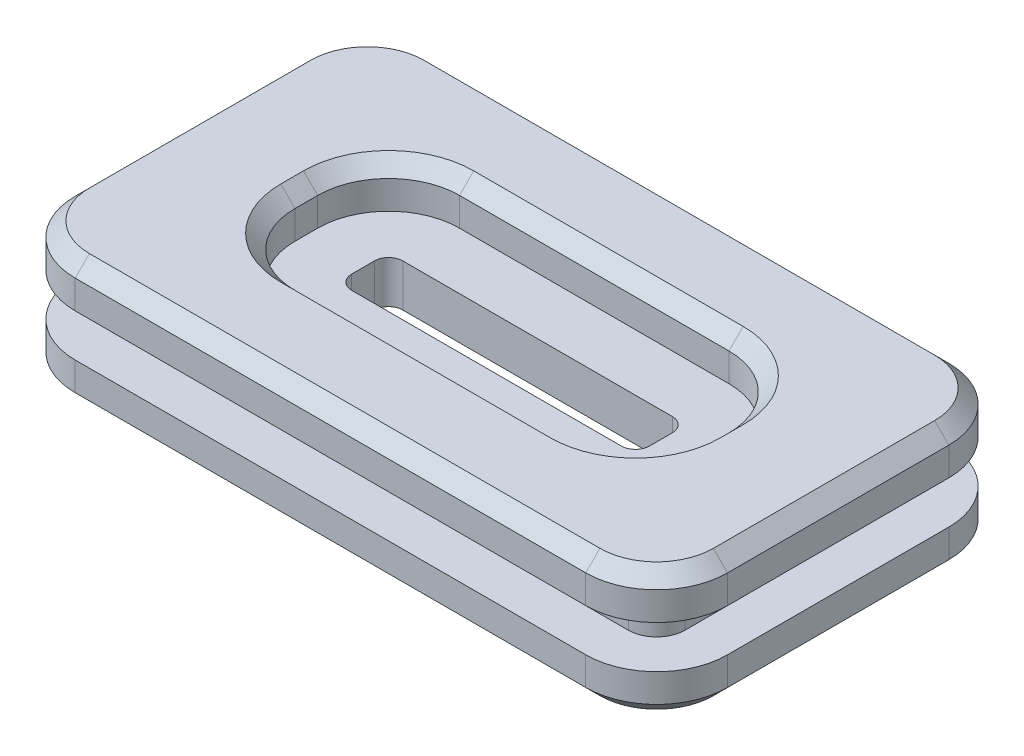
ISO-10303-21;
HEADER;
FILE_DESCRIPTION(('STEP AP214'),'2;1');
FILE_NAME('part.step','',(''),(''),'','','');
FILE_SCHEMA(('AUTOMOTIVE_DESIGN { 1 0 10303 214 1 1 1 1 }'));
ENDSEC;
DATA;
#1=APPLICATION_CONTEXT('core data for automotive mechanical design processes');
#2=APPLICATION_PROTOCOL_DEFINITION('international standard','automotive_design',2000,#1);
#3=PRODUCT_CONTEXT('',#1,'mechanical');
#4=PRODUCT('Part','Part','',(#3));
#5=PRODUCT_RELATED_PRODUCT_CATEGORY('part','',(#4));
#6=PRODUCT_DEFINITION_FORMATION('','',#4);
#7=PRODUCT_DEFINITION_CONTEXT('part definition',#1,'design');
#8=PRODUCT_DEFINITION('design','',#6,#7);
#9=PRODUCT_DEFINITION_SHAPE('','',#8);
#10=(LENGTH_UNIT() NAMED_UNIT(*) SI_UNIT(.MILLI.,.METRE.));
#11=(NAMED_UNIT(*) PLANE_ANGLE_UNIT() SI_UNIT($,.RADIAN.));
#12=(NAMED_UNIT(*) SI_UNIT($,.STERADIAN.) SOLID_ANGLE_UNIT());
#13=UNCERTAINTY_MEASURE_WITH_UNIT(LENGTH_MEASURE(1.E-05),#10,'distance_accuracy_value','');
#14=(GEOMETRIC_REPRESENTATION_CONTEXT(3) GLOBAL_UNCERTAINTY_ASSIGNED_CONTEXT((#13)) GLOBAL_UNIT_ASSIGNED_CONTEXT((#10,
#11,#12)) REPRESENTATION_CONTEXT('',''));
#15=CARTESIAN_POINT('',(0.,0.,0.));
#16=DIRECTION('',(0.,0.,1.));
#17=DIRECTION('',(1.,0.,0.));
#18=AXIS2_PLACEMENT_3D('',#15,#16,#17);
#19=CARTESIAN_POINT('',(-9.,2.25,3.9));
#20=DIRECTION('',(0.,1.,0.));
#21=DIRECTION('',(0.,0.,1.));
#22=AXIS2_PLACEMENT_3D('',#19,#20,#21);
#23=PLANE('',#22);
#24=CARTESIAN_POINT('',(-4.75,2.25000000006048,0.4));
#25=DIRECTION('',(0.,1.,0.));
#26=DIRECTION('',(0.,0.,1.));
#27=AXIS2_PLACEMENT_3D('',#24,#25,#26);
#28=CIRCLE('',#27,2.99999999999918);
#29=CARTESIAN_POINT('',(-4.75,2.25000000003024,3.40000000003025));
#30=VERTEX_POINT('',#29);
#31=CARTESIAN_POINT('',(-7.74999999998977,2.25000000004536,0.4));
#32=VERTEX_POINT('',#31);
#33=EDGE_CURVE('E522',#30,#32,#28,.F.);
#34=ORIENTED_EDGE('',*,*,#33,.T.);
#35=DIRECTION('',(0.,0.,1.));
#36=VECTOR('',#35,1.);
#37=CARTESIAN_POINT('',(-7.75000000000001,2.25,-0.4));
#38=LINE('',#37,#36);
#39=CARTESIAN_POINT('',(-7.75000000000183,2.25000000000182,-0.4));
#40=VERTEX_POINT('',#39);
#41=EDGE_CURVE('E525',#40,#32,#38,.T.);
#42=ORIENTED_EDGE('',*,*,#41,.F.);
#43=CARTESIAN_POINT('',(-4.75,2.25000000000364,-0.4));
#44=DIRECTION('',(0.,1.,0.));
#45=DIRECTION('',(0.,0.,1.));
#46=AXIS2_PLACEMENT_3D('',#43,#44,#45);
#47=CIRCLE('',#46,2.99999999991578);
#48=CARTESIAN_POINT('',(-4.75,2.25000000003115,-3.40000000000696));
#49=VERTEX_POINT('',#48);
#50=EDGE_CURVE('E526',#40,#49,#47,.F.);
#51=ORIENTED_EDGE('',*,*,#50,.T.);
#52=DIRECTION('',(1.,0.,0.));
#53=VECTOR('',#52,1.);
#54=CARTESIAN_POINT('',(4.75,2.25,-3.40000000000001));
#55=LINE('',#54,#53);
#56=CARTESIAN_POINT('',(4.75,2.25000000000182,-3.40000000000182));
#57=VERTEX_POINT('',#56);
#58=EDGE_CURVE('E529',#57,#49,#55,.F.);
#59=ORIENTED_EDGE('',*,*,#58,.F.);
#60=CARTESIAN_POINT('',(4.75,2.25000000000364,-0.4));
#61=DIRECTION('',(0.,1.,0.));
#62=DIRECTION('',(0.,0.,1.));
#63=AXIS2_PLACEMENT_3D('',#60,#61,#62);
#64=CIRCLE('',#63,2.99999999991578);
#65=CARTESIAN_POINT('',(7.75000000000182,2.25000000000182,-0.4));
#66=VERTEX_POINT('',#65);
#67=EDGE_CURVE('E530',#57,#66,#64,.F.);
#68=ORIENTED_EDGE('',*,*,#67,.T.);
#69=DIRECTION('',(0.,0.,1.));
#70=VECTOR('',#69,1.);
#71=CARTESIAN_POINT('',(7.75,2.25,3.9));
#72=LINE('',#71,#70);
#73=CARTESIAN_POINT('',(7.75000000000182,2.25000000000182,0.4));
#74=VERTEX_POINT('',#73);
#75=EDGE_CURVE('E334',#66,#74,#72,.T.);
#76=ORIENTED_EDGE('',*,*,#75,.T.);
#77=CARTESIAN_POINT('',(4.75,2.25000000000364,0.4));
#78=DIRECTION('',(0.,1.,0.));
#79=DIRECTION('',(0.,0.,1.));
#80=AXIS2_PLACEMENT_3D('',#77,#78,#79);
#81=CIRCLE('',#80,2.99999999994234);
#82=CARTESIAN_POINT('',(4.75,2.25000000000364,3.39999999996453));
#83=VERTEX_POINT('',#82);
#84=EDGE_CURVE('E518',#74,#83,#81,.F.);
#85=ORIENTED_EDGE('',*,*,#84,.T.);
#86=DIRECTION('',(1.,0.,0.));
#87=VECTOR('',#86,1.);
#88=CARTESIAN_POINT('',(-4.75,2.25,3.40000000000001));
#89=LINE('',#88,#87);
#90=EDGE_CURVE('E521',#30,#83,#89,.T.);
#91=ORIENTED_EDGE('',*,*,#90,.F.);
#92=EDGE_LOOP('',(#34,#42,#51,#59,#68,#76,#85,#91));
#93=FACE_BOUND('',#92,.T.);
#94=CARTESIAN_POINT('',(9.00000000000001,2.25000000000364,-3.9));
#95=DIRECTION('',(0.,-1.,0.));
#96=DIRECTION('',(0.,0.,-1.));
#97=AXIS2_PLACEMENT_3D('',#94,#95,#96);
#98=CIRCLE('',#97,1.9999999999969);
#99=CARTESIAN_POINT('',(9.00000000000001,2.25000000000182,-5.89999999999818));
#100=VERTEX_POINT('',#99);
#101=CARTESIAN_POINT('',(11.000000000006,2.25000000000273,-3.9));
#102=VERTEX_POINT('',#101);
#103=EDGE_CURVE('E365',#100,#102,#98,.T.);
#104=ORIENTED_EDGE('',*,*,#103,.F.);
#105=DIRECTION('',(1.,0.,0.));
#106=VECTOR('',#105,1.);
#107=CARTESIAN_POINT('',(-9.,2.25,-5.9));
#108=LINE('',#107,#106);
#109=CARTESIAN_POINT('',(-9.,2.25000000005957,-5.89999999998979));
#110=VERTEX_POINT('',#109);
#111=EDGE_CURVE('E369',#110,#100,#108,.T.);
#112=ORIENTED_EDGE('',*,*,#111,.F.);
#113=CARTESIAN_POINT('',(-9.,2.25000000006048,-3.9));
#114=DIRECTION('',(0.,-1.,0.));
#115=DIRECTION('',(0.,0.,-1.));
#116=AXIS2_PLACEMENT_3D('',#113,#114,#115);
#117=CIRCLE('',#116,1.9999999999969);
#118=CARTESIAN_POINT('',(-10.9999999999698,2.25000000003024,-3.9));
#119=VERTEX_POINT('',#118);
#120=EDGE_CURVE('E537',#119,#110,#117,.T.);
#121=ORIENTED_EDGE('',*,*,#120,.F.);
#122=DIRECTION('',(0.,0.,1.));
#123=VECTOR('',#122,1.);
#124=CARTESIAN_POINT('',(-11.,2.25,3.9));
#125=LINE('',#124,#123);
#126=CARTESIAN_POINT('',(-11.0000000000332,2.25000000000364,3.9));
#127=VERTEX_POINT('',#126);
#128=EDGE_CURVE('E587',#127,#119,#125,.F.);
#129=ORIENTED_EDGE('',*,*,#128,.F.);
#130=CARTESIAN_POINT('',(-9.,2.25000000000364,3.9));
#131=DIRECTION('',(0.,-1.,0.));
#132=DIRECTION('',(0.,0.,-1.));
#133=AXIS2_PLACEMENT_3D('',#130,#131,#132);
#134=CIRCLE('',#133,2.00000000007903);
#135=CARTESIAN_POINT('',(-9.,2.25000000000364,5.9000000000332));
#136=VERTEX_POINT('',#135);
#137=EDGE_CURVE('E330',#136,#127,#134,.T.);
#138=ORIENTED_EDGE('',*,*,#137,.F.);
#139=DIRECTION('',(1.,0.,0.));
#140=VECTOR('',#139,1.);
#141=CARTESIAN_POINT('',(-9.,2.25,5.9));
#142=LINE('',#141,#140);
#143=CARTESIAN_POINT('',(9.,2.25000000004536,5.900000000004));
#144=VERTEX_POINT('',#143);
#145=EDGE_CURVE('E327',#144,#136,#142,.F.);
#146=ORIENTED_EDGE('',*,*,#145,.F.);
#147=CARTESIAN_POINT('',(9.00000000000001,2.25000000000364,3.9));
#148=DIRECTION('',(0.,-1.,0.));
#149=DIRECTION('',(0.,0.,-1.));
#150=AXIS2_PLACEMENT_3D('',#147,#148,#149);
#151=CIRCLE('',#150,2.00000000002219);
#152=CARTESIAN_POINT('',(10.9999999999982,2.25000000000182,3.9));
#153=VERTEX_POINT('',#152);
#154=EDGE_CURVE('E20',#153,#144,#151,.T.);
#155=ORIENTED_EDGE('',*,*,#154,.F.);
#156=DIRECTION('',(0.,0.,1.));
#157=VECTOR('',#156,1.);
#158=CARTESIAN_POINT('',(11.,2.25,3.89999999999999));
#159=LINE('',#158,#157);
#160=EDGE_CURVE('E357',#102,#153,#159,.T.);
#161=ORIENTED_EDGE('',*,*,#160,.F.);
#162=EDGE_LOOP('',(#104,#112,#121,#129,#138,#146,#155,#161));
#163=FACE_BOUND('',#162,.T.);
#164=ADVANCED_FACE('F17',(#93,#163),#23,.T.);
#165=CARTESIAN_POINT('',(-9.,2.25,5.9));
#166=DIRECTION('',(0.,0.707106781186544,0.707106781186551));
#167=DIRECTION('',(0.,-0.707106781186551,0.707106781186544));
#168=AXIS2_PLACEMENT_3D('',#165,#166,#167);
#169=PLANE('',#168);
#170=DIRECTION('',(0.,0.707106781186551,-0.707106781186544));
#171=VECTOR('',#170,1.);
#172=CARTESIAN_POINT('',(-8.99999999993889,-498999.650000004,499007.8));
#173=LINE('',#172,#171);
#174=CARTESIAN_POINT('',(-9.,1.75000000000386,6.40000000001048));
#175=VERTEX_POINT('',#174);
#176=EDGE_CURVE('E536',#175,#136,#173,.T.);
#177=ORIENTED_EDGE('',*,*,#176,.F.);
#178=DIRECTION('',(-1.,0.,0.));
#179=VECTOR('',#178,1.);
#180=CARTESIAN_POINT('',(-9.,1.75,6.4));
#181=LINE('',#180,#179);
#182=CARTESIAN_POINT('',(9.00000000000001,1.75000000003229,6.39999999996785));
#183=VERTEX_POINT('',#182);
#184=EDGE_CURVE('E341',#175,#183,#181,.F.);
#185=ORIENTED_EDGE('',*,*,#184,.T.);
#186=DIRECTION('',(0.,0.707106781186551,-0.707106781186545));
#187=VECTOR('',#186,1.);
#188=CARTESIAN_POINT('',(8.99999999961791,-498999.650000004,499007.8));
#189=LINE('',#188,#187);
#190=EDGE_CURVE('E338',#144,#183,#189,.F.);
#191=ORIENTED_EDGE('',*,*,#190,.F.);
#192=ORIENTED_EDGE('',*,*,#145,.T.);
#193=EDGE_LOOP('',(#177,#185,#191,#192));
#194=FACE_BOUND('',#193,.T.);
#195=ADVANCED_FACE('F339',(#194),#169,.T.);
#196=CARTESIAN_POINT('',(9.00000000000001,1.75000000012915,3.9));
#197=DIRECTION('',(0.,-1.,0.));
#198=DIRECTION('',(0.,0.,-1.));
#199=AXIS2_PLACEMENT_3D('',#196,#197,#198);
#200=CONICAL_SURFACE('',#199,2.49999999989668,0.785398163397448);
#201=ORIENTED_EDGE('',*,*,#190,.T.);
#202=CARTESIAN_POINT('',(9.00000000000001,1.75,3.9));
#203=DIRECTION('',(0.,-1.,0.));
#204=DIRECTION('',(0.,0.,-1.));
#205=AXIS2_PLACEMENT_3D('',#202,#203,#204);
#206=CIRCLE('',#205,2.5);
#207=CARTESIAN_POINT('',(11.5,1.75,3.9));
#208=VERTEX_POINT('',#207);
#209=EDGE_CURVE('E352',#208,#183,#206,.T.);
#210=ORIENTED_EDGE('',*,*,#209,.F.);
#211=DIRECTION('',(-0.707106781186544,0.707106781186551,0.));
#212=VECTOR('',#211,1.);
#213=CARTESIAN_POINT('',(11.,2.25,3.9));
#214=LINE('',#213,#212);
#215=EDGE_CURVE('E345',#153,#208,#214,.F.);
#216=ORIENTED_EDGE('',*,*,#215,.F.);
#217=ORIENTED_EDGE('',*,*,#154,.T.);
#218=EDGE_LOOP('',(#201,#210,#216,#217));
#219=FACE_BOUND('',#218,.T.);
#220=ADVANCED_FACE('F347',(#219),#200,.T.);
#221=CARTESIAN_POINT('',(11.,2.25,3.89999999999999));
#222=DIRECTION('',(0.707106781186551,0.707106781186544,0.));
#223=DIRECTION('',(-0.707106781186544,0.707106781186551,0.));
#224=AXIS2_PLACEMENT_3D('',#221,#222,#223);
#225=PLANE('',#224);
#226=DIRECTION('',(-0.707106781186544,0.707106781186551,0.));
#227=VECTOR('',#226,1.);
#228=CARTESIAN_POINT('',(499005.1,-498991.850000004,-3.90000000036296));
#229=LINE('',#228,#227);
#230=CARTESIAN_POINT('',(11.5000000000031,1.74999999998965,-3.9));
#231=VERTEX_POINT('',#230);
#232=EDGE_CURVE('E362',#102,#231,#229,.F.);
#233=ORIENTED_EDGE('',*,*,#232,.F.);
#234=ORIENTED_EDGE('',*,*,#160,.T.);
#235=ORIENTED_EDGE('',*,*,#215,.T.);
#236=DIRECTION('',(0.,0.,1.));
#237=VECTOR('',#236,1.);
#238=CARTESIAN_POINT('',(11.5,1.75,3.9));
#239=LINE('',#238,#237);
#240=EDGE_CURVE('E561',#208,#231,#239,.F.);
#241=ORIENTED_EDGE('',*,*,#240,.T.);
#242=EDGE_LOOP('',(#233,#234,#235,#241));
#243=FACE_BOUND('',#242,.T.);
#244=ADVANCED_FACE('F360',(#243),#225,.T.);
#245=CARTESIAN_POINT('',(9.00000000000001,1.74999999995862,-3.9));
#246=DIRECTION('',(0.,-1.,0.));
#247=DIRECTION('',(0.,0.,-1.));
#248=AXIS2_PLACEMENT_3D('',#245,#246,#247);
#249=CONICAL_SURFACE('',#248,2.49999999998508,0.785398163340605);
#250=DIRECTION('',(0.,0.707106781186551,0.707106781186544));
#251=VECTOR('',#250,1.);
#252=CARTESIAN_POINT('',(9.00000000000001,2.25,-5.9));
#253=LINE('',#252,#251);
#254=CARTESIAN_POINT('',(9.00000000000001,1.75,-6.4));
#255=VERTEX_POINT('',#254);
#256=EDGE_CURVE('E541',#100,#255,#253,.F.);
#257=ORIENTED_EDGE('',*,*,#256,.F.);
#258=ORIENTED_EDGE('',*,*,#103,.T.);
#259=ORIENTED_EDGE('',*,*,#232,.T.);
#260=CARTESIAN_POINT('',(9.00000000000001,1.75,-3.9));
#261=DIRECTION('',(0.,-1.,0.));
#262=DIRECTION('',(0.,0.,-1.));
#263=AXIS2_PLACEMENT_3D('',#260,#261,#262);
#264=CIRCLE('',#263,2.5);
#265=EDGE_CURVE('E557',#255,#231,#264,.T.);
#266=ORIENTED_EDGE('',*,*,#265,.F.);
#267=EDGE_LOOP('',(#257,#258,#259,#266));
#268=FACE_BOUND('',#267,.T.);
#269=ADVANCED_FACE('F1941',(#268),#249,.T.);
#270=CARTESIAN_POINT('',(-9.,2.25,-5.9));
#271=DIRECTION('',(0.,0.707106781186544,-0.707106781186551));
#272=DIRECTION('',(0.,0.707106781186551,0.707106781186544));
#273=AXIS2_PLACEMENT_3D('',#270,#271,#272);
#274=PLANE('',#273);
#275=DIRECTION('',(0.,0.70710678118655,0.707106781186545));
#276=VECTOR('',#275,1.);
#277=CARTESIAN_POINT('',(-9.,-498991.850000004,-499000.));
#278=LINE('',#277,#276);
#279=CARTESIAN_POINT('',(-9.,1.75000000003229,-6.39999999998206));
#280=VERTEX_POINT('',#279);
#281=EDGE_CURVE('E540',#110,#280,#278,.F.);
#282=ORIENTED_EDGE('',*,*,#281,.F.);
#283=ORIENTED_EDGE('',*,*,#111,.T.);
#284=ORIENTED_EDGE('',*,*,#256,.T.);
#285=DIRECTION('',(1.,0.,0.));
#286=VECTOR('',#285,1.);
#287=CARTESIAN_POINT('',(9.00000000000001,1.75,-6.4));
#288=LINE('',#287,#286);
#289=EDGE_CURVE('E608',#255,#280,#288,.F.);
#290=ORIENTED_EDGE('',*,*,#289,.T.);
#291=EDGE_LOOP('',(#282,#283,#284,#290));
#292=FACE_BOUND('',#291,.T.);
#293=ADVANCED_FACE('F1932',(#292),#274,.T.);
#294=CARTESIAN_POINT('',(-9.,1.75000000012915,-3.9));
#295=DIRECTION('',(0.,-1.,0.));
#296=DIRECTION('',(0.,0.,-1.));
#297=AXIS2_PLACEMENT_3D('',#294,#295,#296);
#298=CONICAL_SURFACE('',#297,2.49999999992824,0.785398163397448);
#299=DIRECTION('',(-0.707106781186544,-0.707106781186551,0.));
#300=VECTOR('',#299,1.);
#301=CARTESIAN_POINT('',(-11.,2.25,-3.9));
#302=LINE('',#301,#300);
#303=CARTESIAN_POINT('',(-11.5,1.75,-3.9));
#304=VERTEX_POINT('',#303);
#305=EDGE_CURVE('E539',#119,#304,#302,.T.);
#306=ORIENTED_EDGE('',*,*,#305,.F.);
#307=ORIENTED_EDGE('',*,*,#120,.T.);
#308=ORIENTED_EDGE('',*,*,#281,.T.);
#309=CARTESIAN_POINT('',(-9.,1.75,-3.9));
#310=DIRECTION('',(0.,-1.,0.));
#311=DIRECTION('',(0.,0.,-1.));
#312=AXIS2_PLACEMENT_3D('',#309,#310,#311);
#313=CIRCLE('',#312,2.5);
#314=EDGE_CURVE('E604',#304,#280,#313,.T.);
#315=ORIENTED_EDGE('',*,*,#314,.F.);
#316=EDGE_LOOP('',(#306,#307,#308,#315));
#317=FACE_BOUND('',#316,.T.);
#318=ADVANCED_FACE('F620',(#317),#298,.T.);
#319=CARTESIAN_POINT('',(-11.,2.25,3.9));
#320=DIRECTION('',(-0.707106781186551,0.707106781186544,0.));
#321=DIRECTION('',(-0.707106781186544,-0.707106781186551,0.));
#322=AXIS2_PLACEMENT_3D('',#319,#320,#321);
#323=PLANE('',#322);
#324=DIRECTION('',(0.707106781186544,0.707106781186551,0.));
#325=VECTOR('',#324,1.);
#326=CARTESIAN_POINT('',(-499012.9,-498999.650000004,3.90000000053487));
#327=LINE('',#326,#325);
#328=CARTESIAN_POINT('',(-11.5000000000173,1.75000000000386,3.9));
#329=VERTEX_POINT('',#328);
#330=EDGE_CURVE('E534',#127,#329,#327,.F.);
#331=ORIENTED_EDGE('',*,*,#330,.F.);
#332=ORIENTED_EDGE('',*,*,#128,.T.);
#333=ORIENTED_EDGE('',*,*,#305,.T.);
#334=DIRECTION('',(0.,0.,-1.));
#335=VECTOR('',#334,1.);
#336=CARTESIAN_POINT('',(-11.5,1.75,-3.9));
#337=LINE('',#336,#335);
#338=EDGE_CURVE('E638',#304,#329,#337,.F.);
#339=ORIENTED_EDGE('',*,*,#338,.T.);
#340=EDGE_LOOP('',(#331,#332,#333,#339));
#341=FACE_BOUND('',#340,.T.);
#342=ADVANCED_FACE('F1915',(#341),#323,.T.);
#343=CARTESIAN_POINT('',(-9.,1.75000000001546,3.9));
#344=DIRECTION('',(0.,-1.,0.));
#345=DIRECTION('',(0.,0.,-1.));
#346=AXIS2_PLACEMENT_3D('',#343,#344,#345);
#347=CONICAL_SURFACE('',#346,2.50000000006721,0.785398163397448);
#348=ORIENTED_EDGE('',*,*,#330,.T.);
#349=CARTESIAN_POINT('',(-9.,1.75,3.9));
#350=DIRECTION('',(0.,-1.,0.));
#351=DIRECTION('',(0.,0.,-1.));
#352=AXIS2_PLACEMENT_3D('',#349,#350,#351);
#353=CIRCLE('',#352,2.5);
#354=EDGE_CURVE('E749',#175,#329,#353,.T.);
#355=ORIENTED_EDGE('',*,*,#354,.F.);
#356=ORIENTED_EDGE('',*,*,#176,.T.);
#357=ORIENTED_EDGE('',*,*,#137,.T.);
#358=EDGE_LOOP('',(#348,#355,#356,#357));
#359=FACE_BOUND('',#358,.T.);
#360=ADVANCED_FACE('F763',(#359),#347,.T.);
#361=CARTESIAN_POINT('',(4.75,2.25000000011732,-0.4));
#362=DIRECTION('',(0.,1.,0.));
#363=DIRECTION('',(0.,0.,1.));
#364=AXIS2_PLACEMENT_3D('',#361,#362,#363);
#365=CONICAL_SURFACE('',#364,3.00000000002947,0.785398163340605);
#366=ORIENTED_EDGE('',*,*,#67,.F.);
#367=DIRECTION('',(0.,-0.707106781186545,0.70710678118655));
#368=VECTOR('',#367,1.);
#369=CARTESIAN_POINT('',(4.75,1.75,-2.9));
#370=LINE('',#369,#368);
#371=CARTESIAN_POINT('',(4.75,1.75,-2.9));
#372=VERTEX_POINT('',#371);
#373=EDGE_CURVE('E533',#372,#57,#370,.F.);
#374=ORIENTED_EDGE('',*,*,#373,.F.);
#375=CARTESIAN_POINT('',(4.75,1.75,-0.4));
#376=DIRECTION('',(0.,1.,0.));
#377=DIRECTION('',(0.,0.,1.));
#378=AXIS2_PLACEMENT_3D('',#375,#376,#377);
#379=CIRCLE('',#378,2.5);
#380=CARTESIAN_POINT('',(7.25,1.75,-0.4));
#381=VERTEX_POINT('',#380);
#382=EDGE_CURVE('E688',#372,#381,#379,.F.);
#383=ORIENTED_EDGE('',*,*,#382,.T.);
#384=DIRECTION('',(-0.707106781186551,-0.707106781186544,0.));
#385=VECTOR('',#384,1.);
#386=CARTESIAN_POINT('',(7.25,1.75,-0.4));
#387=LINE('',#386,#385);
#388=EDGE_CURVE('E681',#66,#381,#387,.T.);
#389=ORIENTED_EDGE('',*,*,#388,.F.);
#390=EDGE_LOOP('',(#366,#374,#383,#389));
#391=FACE_BOUND('',#390,.T.);
#392=ADVANCED_FACE('F1896',(#391),#365,.F.);
#393=CARTESIAN_POINT('',(4.75,1.75,-2.9));
#394=DIRECTION('',(0.,0.70710678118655,0.707106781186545));
#395=DIRECTION('',(0.,-0.707106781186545,0.70710678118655));
#396=AXIS2_PLACEMENT_3D('',#393,#394,#395);
#397=PLANE('',#396);
#398=DIRECTION('',(0.,-0.707106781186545,0.70710678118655));
#399=VECTOR('',#398,1.);
#400=CARTESIAN_POINT('',(-4.74999999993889,498999.649999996,-499000.8));
#401=LINE('',#400,#399);
#402=CARTESIAN_POINT('',(-4.75,1.75000000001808,-2.90000000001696));
#403=VERTEX_POINT('',#402);
#404=EDGE_CURVE('E528',#49,#403,#401,.T.);
#405=ORIENTED_EDGE('',*,*,#404,.T.);
#406=DIRECTION('',(-1.,0.,0.));
#407=VECTOR('',#406,1.);
#408=CARTESIAN_POINT('',(4.75,1.75,-2.9));
#409=LINE('',#408,#407);
#410=EDGE_CURVE('E691',#403,#372,#409,.F.);
#411=ORIENTED_EDGE('',*,*,#410,.T.);
#412=ORIENTED_EDGE('',*,*,#373,.T.);
#413=ORIENTED_EDGE('',*,*,#58,.T.);
#414=EDGE_LOOP('',(#405,#411,#412,#413));
#415=FACE_BOUND('',#414,.T.);
#416=ADVANCED_FACE('F1886',(#415),#397,.T.);
#417=CARTESIAN_POINT('',(-4.75,2.25000000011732,-0.4));
#418=DIRECTION('',(0.,1.,0.));
#419=DIRECTION('',(0.,0.,1.));
#420=AXIS2_PLACEMENT_3D('',#417,#418,#419);
#421=CONICAL_SURFACE('',#420,3.00000000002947,0.785398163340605);
#422=CARTESIAN_POINT('',(-4.75,1.75,-0.4));
#423=DIRECTION('',(0.,1.,0.));
#424=DIRECTION('',(0.,0.,1.));
#425=AXIS2_PLACEMENT_3D('',#422,#423,#424);
#426=CIRCLE('',#425,2.5);
#427=CARTESIAN_POINT('',(-7.25,1.75,-0.4));
#428=VERTEX_POINT('',#427);
#429=EDGE_CURVE('E725',#428,#403,#426,.F.);
#430=ORIENTED_EDGE('',*,*,#429,.T.);
#431=ORIENTED_EDGE('',*,*,#404,.F.);
#432=ORIENTED_EDGE('',*,*,#50,.F.);
#433=DIRECTION('',(-0.70710678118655,0.707106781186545,0.));
#434=VECTOR('',#433,1.);
#435=CARTESIAN_POINT('',(-7.25,1.75,-0.4));
#436=LINE('',#435,#434);
#437=EDGE_CURVE('E584',#428,#40,#436,.T.);
#438=ORIENTED_EDGE('',*,*,#437,.F.);
#439=EDGE_LOOP('',(#430,#431,#432,#438));
#440=FACE_BOUND('',#439,.T.);
#441=ADVANCED_FACE('F1876',(#440),#421,.F.);
#442=CARTESIAN_POINT('',(-7.25,1.75,-0.4));
#443=DIRECTION('',(0.707106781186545,0.70710678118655,0.));
#444=DIRECTION('',(-0.70710678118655,0.707106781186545,0.));
#445=AXIS2_PLACEMENT_3D('',#442,#443,#444);
#446=PLANE('',#445);
#447=ORIENTED_EDGE('',*,*,#437,.T.);
#448=ORIENTED_EDGE('',*,*,#41,.T.);
#449=DIRECTION('',(0.70710678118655,-0.707106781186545,0.));
#450=VECTOR('',#449,1.);
#451=CARTESIAN_POINT('',(-499004.35,498998.849999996,0.399999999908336));
#452=LINE('',#451,#450);
#453=CARTESIAN_POINT('',(-7.24999999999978,1.75000000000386,0.4));
#454=VERTEX_POINT('',#453);
#455=EDGE_CURVE('E524',#32,#454,#452,.T.);
#456=ORIENTED_EDGE('',*,*,#455,.T.);
#457=DIRECTION('',(0.,0.,1.));
#458=VECTOR('',#457,1.);
#459=CARTESIAN_POINT('',(-7.25,1.75,-0.4));
#460=LINE('',#459,#458);
#461=EDGE_CURVE('E715',#454,#428,#460,.F.);
#462=ORIENTED_EDGE('',*,*,#461,.T.);
#463=EDGE_LOOP('',(#447,#448,#456,#462));
#464=FACE_BOUND('',#463,.T.);
#465=ADVANCED_FACE('F1866',(#464),#446,.T.);
#466=CARTESIAN_POINT('',(-4.75,2.25000000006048,0.4));
#467=DIRECTION('',(0.,1.,0.));
#468=DIRECTION('',(0.,0.,1.));
#469=AXIS2_PLACEMENT_3D('',#466,#467,#468);
#470=CONICAL_SURFACE('',#469,2.99999999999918,0.785398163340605);
#471=CARTESIAN_POINT('',(-4.75,1.75,0.4));
#472=DIRECTION('',(0.,1.,0.));
#473=DIRECTION('',(0.,0.,1.));
#474=AXIS2_PLACEMENT_3D('',#471,#472,#473);
#475=CIRCLE('',#474,2.5);
#476=CARTESIAN_POINT('',(-4.75,1.75,2.9));
#477=VERTEX_POINT('',#476);
#478=EDGE_CURVE('E705',#477,#454,#475,.F.);
#479=ORIENTED_EDGE('',*,*,#478,.T.);
#480=ORIENTED_EDGE('',*,*,#455,.F.);
#481=ORIENTED_EDGE('',*,*,#33,.F.);
#482=DIRECTION('',(0.,0.707106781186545,0.70710678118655));
#483=VECTOR('',#482,1.);
#484=CARTESIAN_POINT('',(-4.75,1.75,2.9));
#485=LINE('',#484,#483);
#486=EDGE_CURVE('E580',#477,#30,#485,.T.);
#487=ORIENTED_EDGE('',*,*,#486,.F.);
#488=EDGE_LOOP('',(#479,#480,#481,#487));
#489=FACE_BOUND('',#488,.T.);
#490=ADVANCED_FACE('F1856',(#489),#470,.F.);
#491=CARTESIAN_POINT('',(-4.75,1.75,2.9));
#492=DIRECTION('',(0.,0.70710678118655,-0.707106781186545));
#493=DIRECTION('',(0.,0.707106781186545,0.70710678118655));
#494=AXIS2_PLACEMENT_3D('',#491,#492,#493);
#495=PLANE('',#494);
#496=DIRECTION('',(0.,-0.707106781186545,-0.70710678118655));
#497=VECTOR('',#496,1.);
#498=CARTESIAN_POINT('',(4.75,498998.849999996,499000.));
#499=LINE('',#498,#497);
#500=CARTESIAN_POINT('',(4.75,1.75000000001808,2.90000000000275));
#501=VERTEX_POINT('',#500);
#502=EDGE_CURVE('E520',#83,#501,#499,.T.);
#503=ORIENTED_EDGE('',*,*,#502,.T.);
#504=DIRECTION('',(1.,0.,0.));
#505=VECTOR('',#504,1.);
#506=CARTESIAN_POINT('',(-4.75,1.75,2.9));
#507=LINE('',#506,#505);
#508=EDGE_CURVE('E695',#501,#477,#507,.F.);
#509=ORIENTED_EDGE('',*,*,#508,.T.);
#510=ORIENTED_EDGE('',*,*,#486,.T.);
#511=ORIENTED_EDGE('',*,*,#90,.T.);
#512=EDGE_LOOP('',(#503,#509,#510,#511));
#513=FACE_BOUND('',#512,.T.);
#514=ADVANCED_FACE('F1846',(#513),#495,.T.);
#515=CARTESIAN_POINT('',(4.75,2.25000000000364,0.4));
#516=DIRECTION('',(0.,1.,0.));
#517=DIRECTION('',(0.,0.,1.));
#518=AXIS2_PLACEMENT_3D('',#515,#516,#517);
#519=CONICAL_SURFACE('',#518,2.99999999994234,0.785398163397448);
#520=ORIENTED_EDGE('',*,*,#84,.F.);
#521=DIRECTION('',(-0.707106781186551,-0.707106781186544,0.));
#522=VECTOR('',#521,1.);
#523=CARTESIAN_POINT('',(7.25,1.75,0.4));
#524=LINE('',#523,#522);
#525=CARTESIAN_POINT('',(7.25,1.75,0.4));
#526=VERTEX_POINT('',#525);
#527=EDGE_CURVE('E678',#526,#74,#524,.F.);
#528=ORIENTED_EDGE('',*,*,#527,.F.);
#529=CARTESIAN_POINT('',(4.75,1.75,0.4));
#530=DIRECTION('',(0.,1.,0.));
#531=DIRECTION('',(0.,0.,1.));
#532=AXIS2_PLACEMENT_3D('',#529,#530,#531);
#533=CIRCLE('',#532,2.5);
#534=EDGE_CURVE('E665',#526,#501,#533,.F.);
#535=ORIENTED_EDGE('',*,*,#534,.T.);
#536=ORIENTED_EDGE('',*,*,#502,.F.);
#537=EDGE_LOOP('',(#520,#528,#535,#536));
#538=FACE_BOUND('',#537,.T.);
#539=ADVANCED_FACE('F1836',(#538),#519,.F.);
#540=CARTESIAN_POINT('',(7.25,1.75,0.4));
#541=DIRECTION('',(-0.707106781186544,0.707106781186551,0.));
#542=DIRECTION('',(-0.707106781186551,-0.707106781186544,0.));
#543=AXIS2_PLACEMENT_3D('',#540,#541,#542);
#544=PLANE('',#543);
#545=ORIENTED_EDGE('',*,*,#388,.T.);
#546=DIRECTION('',(0.,0.,-1.));
#547=VECTOR('',#546,1.);
#548=CARTESIAN_POINT('',(7.25,1.75,0.4));
#549=LINE('',#548,#547);
#550=EDGE_CURVE('E672',#381,#526,#549,.F.);
#551=ORIENTED_EDGE('',*,*,#550,.T.);
#552=ORIENTED_EDGE('',*,*,#527,.T.);
#553=ORIENTED_EDGE('',*,*,#75,.F.);
#554=EDGE_LOOP('',(#545,#551,#552,#553));
#555=FACE_BOUND('',#554,.T.);
#556=ADVANCED_FACE('F1827',(#555),#544,.T.);
#557=CARTESIAN_POINT('',(-9.,2.25,6.4));
#558=DIRECTION('',(0.,0.,-1.));
#559=DIRECTION('',(-1.,0.,0.));
#560=AXIS2_PLACEMENT_3D('',#557,#558,#559);
#561=PLANE('',#560);
#562=ORIENTED_EDGE('',*,*,#184,.F.);
#563=DIRECTION('',(0.,-1.,0.));
#564=VECTOR('',#563,1.);
#565=CARTESIAN_POINT('',(-9.,2.25,6.4));
#566=LINE('',#565,#564);
#567=CARTESIAN_POINT('',(-9.,0.75,6.4));
#568=VERTEX_POINT('',#567);
#569=EDGE_CURVE('E640',#568,#175,#566,.F.);
#570=ORIENTED_EDGE('',*,*,#569,.F.);
#571=DIRECTION('',(1.,0.,0.));
#572=VECTOR('',#571,1.);
#573=CARTESIAN_POINT('',(-9.,0.75,6.4));
#574=LINE('',#573,#572);
#575=CARTESIAN_POINT('',(9.00000000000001,0.75,6.4));
#576=VERTEX_POINT('',#575);
#577=EDGE_CURVE('E514',#568,#576,#574,.T.);
#578=ORIENTED_EDGE('',*,*,#577,.T.);
#579=DIRECTION('',(0.,-1.,0.));
#580=VECTOR('',#579,1.);
#581=CARTESIAN_POINT('',(9.00000000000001,2.25,6.4));
#582=LINE('',#581,#580);
#583=EDGE_CURVE('E573',#183,#576,#582,.T.);
#584=ORIENTED_EDGE('',*,*,#583,.F.);
#585=EDGE_LOOP('',(#562,#570,#578,#584));
#586=FACE_BOUND('',#585,.T.);
#587=ADVANCED_FACE('F1817',(#586),#561,.F.);
#588=CARTESIAN_POINT('',(9.00000000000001,2.25,3.9));
#589=DIRECTION('',(0.,-1.,0.));
#590=DIRECTION('',(0.,0.,-1.));
#591=AXIS2_PLACEMENT_3D('',#588,#589,#590);
#592=CYLINDRICAL_SURFACE('',#591,2.5);
#593=ORIENTED_EDGE('',*,*,#583,.T.);
#594=CARTESIAN_POINT('',(9.00000000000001,0.75,3.9));
#595=DIRECTION('',(0.,-1.,0.));
#596=DIRECTION('',(0.,0.,-1.));
#597=AXIS2_PLACEMENT_3D('',#594,#595,#596);
#598=CIRCLE('',#597,2.5);
#599=CARTESIAN_POINT('',(11.5,0.75,3.9));
#600=VERTEX_POINT('',#599);
#601=EDGE_CURVE('E512',#576,#600,#598,.F.);
#602=ORIENTED_EDGE('',*,*,#601,.T.);
#603=DIRECTION('',(0.,1.,0.));
#604=VECTOR('',#603,1.);
#605=CARTESIAN_POINT('',(11.5,2.25,3.9));
#606=LINE('',#605,#604);
#607=EDGE_CURVE('E565',#600,#208,#606,.T.);
#608=ORIENTED_EDGE('',*,*,#607,.T.);
#609=ORIENTED_EDGE('',*,*,#209,.T.);
#610=EDGE_LOOP('',(#593,#602,#608,#609));
#611=FACE_BOUND('',#610,.T.);
#612=ADVANCED_FACE('F1807',(#611),#592,.T.);
#613=CARTESIAN_POINT('',(11.5,2.25,3.9));
#614=DIRECTION('',(-1.,0.,0.));
#615=DIRECTION('',(0.,0.,1.));
#616=AXIS2_PLACEMENT_3D('',#613,#614,#615);
#617=PLANE('',#616);
#618=ORIENTED_EDGE('',*,*,#240,.F.);
#619=ORIENTED_EDGE('',*,*,#607,.F.);
#620=DIRECTION('',(0.,0.,1.));
#621=VECTOR('',#620,1.);
#622=CARTESIAN_POINT('',(11.5,0.75,3.9));
#623=LINE('',#622,#621);
#624=CARTESIAN_POINT('',(11.5,0.75,-3.9));
#625=VERTEX_POINT('',#624);
#626=EDGE_CURVE('E511',#600,#625,#623,.F.);
#627=ORIENTED_EDGE('',*,*,#626,.T.);
#628=DIRECTION('',(0.,-1.,0.));
#629=VECTOR('',#628,1.);
#630=CARTESIAN_POINT('',(11.5,2.25,-3.9));
#631=LINE('',#630,#629);
#632=EDGE_CURVE('E560',#231,#625,#631,.T.);
#633=ORIENTED_EDGE('',*,*,#632,.F.);
#634=EDGE_LOOP('',(#618,#619,#627,#633));
#635=FACE_BOUND('',#634,.T.);
#636=ADVANCED_FACE('F1797',(#635),#617,.F.);
#637=CARTESIAN_POINT('',(9.00000000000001,2.25,-3.9));
#638=DIRECTION('',(0.,-1.,0.));
#639=DIRECTION('',(0.,0.,-1.));
#640=AXIS2_PLACEMENT_3D('',#637,#638,#639);
#641=CYLINDRICAL_SURFACE('',#640,2.5);
#642=ORIENTED_EDGE('',*,*,#632,.T.);
#643=CARTESIAN_POINT('',(9.00000000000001,0.75,-3.9));
#644=DIRECTION('',(0.,-1.,0.));
#645=DIRECTION('',(0.,0.,-1.));
#646=AXIS2_PLACEMENT_3D('',#643,#644,#645);
#647=CIRCLE('',#646,2.5);
#648=CARTESIAN_POINT('',(9.00000000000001,0.75,-6.4));
#649=VERTEX_POINT('',#648);
#650=EDGE_CURVE('E509',#625,#649,#647,.F.);
#651=ORIENTED_EDGE('',*,*,#650,.T.);
#652=DIRECTION('',(0.,1.,0.));
#653=VECTOR('',#652,1.);
#654=CARTESIAN_POINT('',(9.00000000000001,2.25,-6.4));
#655=LINE('',#654,#653);
#656=EDGE_CURVE('E612',#649,#255,#655,.T.);
#657=ORIENTED_EDGE('',*,*,#656,.T.);
#658=ORIENTED_EDGE('',*,*,#265,.T.);
#659=EDGE_LOOP('',(#642,#651,#657,#658));
#660=FACE_BOUND('',#659,.T.);
#661=ADVANCED_FACE('F1788',(#660),#641,.T.);
#662=CARTESIAN_POINT('',(9.00000000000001,2.25,-6.4));
#663=DIRECTION('',(0.,0.,1.));
#664=DIRECTION('',(1.,0.,0.));
#665=AXIS2_PLACEMENT_3D('',#662,#663,#664);
#666=PLANE('',#665);
#667=ORIENTED_EDGE('',*,*,#289,.F.);
#668=ORIENTED_EDGE('',*,*,#656,.F.);
#669=DIRECTION('',(1.,0.,0.));
#670=VECTOR('',#669,1.);
#671=CARTESIAN_POINT('',(-9.,0.75,-6.4));
#672=LINE('',#671,#670);
#673=CARTESIAN_POINT('',(-9.,0.75,-6.4));
#674=VERTEX_POINT('',#673);
#675=EDGE_CURVE('E508',#649,#674,#672,.F.);
#676=ORIENTED_EDGE('',*,*,#675,.T.);
#677=DIRECTION('',(0.,-1.,0.));
#678=VECTOR('',#677,1.);
#679=CARTESIAN_POINT('',(-9.,2.25,-6.4));
#680=LINE('',#679,#678);
#681=EDGE_CURVE('E607',#280,#674,#680,.T.);
#682=ORIENTED_EDGE('',*,*,#681,.F.);
#683=EDGE_LOOP('',(#667,#668,#676,#682));
#684=FACE_BOUND('',#683,.T.);
#685=ADVANCED_FACE('F625',(#684),#666,.F.);
#686=CARTESIAN_POINT('',(-9.,2.25,-3.9));
#687=DIRECTION('',(0.,-1.,0.));
#688=DIRECTION('',(0.,0.,-1.));
#689=AXIS2_PLACEMENT_3D('',#686,#687,#688);
#690=CYLINDRICAL_SURFACE('',#689,2.5);
#691=ORIENTED_EDGE('',*,*,#681,.T.);
#692=CARTESIAN_POINT('',(-9.,0.75,-3.9));
#693=DIRECTION('',(0.,-1.,0.));
#694=DIRECTION('',(0.,0.,-1.));
#695=AXIS2_PLACEMENT_3D('',#692,#693,#694);
#696=CIRCLE('',#695,2.5);
#697=CARTESIAN_POINT('',(-11.5,0.75,-3.9));
#698=VERTEX_POINT('',#697);
#699=EDGE_CURVE('E506',#674,#698,#696,.F.);
#700=ORIENTED_EDGE('',*,*,#699,.T.);
#701=DIRECTION('',(0.,1.,0.));
#702=VECTOR('',#701,1.);
#703=CARTESIAN_POINT('',(-11.5,2.25,-3.9));
#704=LINE('',#703,#702);
#705=EDGE_CURVE('E630',#698,#304,#704,.T.);
#706=ORIENTED_EDGE('',*,*,#705,.T.);
#707=ORIENTED_EDGE('',*,*,#314,.T.);
#708=EDGE_LOOP('',(#691,#700,#706,#707));
#709=FACE_BOUND('',#708,.T.);
#710=ADVANCED_FACE('F632',(#709),#690,.T.);
#711=CARTESIAN_POINT('',(-11.5,2.25,-3.9));
#712=DIRECTION('',(1.,0.,0.));
#713=DIRECTION('',(0.,0.,-1.));
#714=AXIS2_PLACEMENT_3D('',#711,#712,#713);
#715=PLANE('',#714);
#716=ORIENTED_EDGE('',*,*,#338,.F.);
#717=ORIENTED_EDGE('',*,*,#705,.F.);
#718=DIRECTION('',(0.,0.,1.));
#719=VECTOR('',#718,1.);
#720=CARTESIAN_POINT('',(-11.5,0.75,3.9));
#721=LINE('',#720,#719);
#722=CARTESIAN_POINT('',(-11.5,0.75,3.9));
#723=VERTEX_POINT('',#722);
#724=EDGE_CURVE('E505',#698,#723,#721,.T.);
#725=ORIENTED_EDGE('',*,*,#724,.T.);
#726=DIRECTION('',(0.,-1.,0.));
#727=VECTOR('',#726,1.);
#728=CARTESIAN_POINT('',(-11.5,2.25,3.9));
#729=LINE('',#728,#727);
#730=EDGE_CURVE('E692',#329,#723,#729,.T.);
#731=ORIENTED_EDGE('',*,*,#730,.F.);
#732=EDGE_LOOP('',(#716,#717,#725,#731));
#733=FACE_BOUND('',#732,.T.);
#734=ADVANCED_FACE('F768',(#733),#715,.F.);
#735=CARTESIAN_POINT('',(-9.,2.25,3.9));
#736=DIRECTION('',(0.,-1.,0.));
#737=DIRECTION('',(0.,0.,-1.));
#738=AXIS2_PLACEMENT_3D('',#735,#736,#737);
#739=CYLINDRICAL_SURFACE('',#738,2.5);
#740=ORIENTED_EDGE('',*,*,#730,.T.);
#741=CARTESIAN_POINT('',(-9.,0.75,3.9));
#742=DIRECTION('',(0.,-1.,0.));
#743=DIRECTION('',(0.,0.,-1.));
#744=AXIS2_PLACEMENT_3D('',#741,#742,#743);
#745=CIRCLE('',#744,2.5);
#746=EDGE_CURVE('E502',#723,#568,#745,.F.);
#747=ORIENTED_EDGE('',*,*,#746,.T.);
#748=ORIENTED_EDGE('',*,*,#569,.T.);
#749=ORIENTED_EDGE('',*,*,#354,.T.);
#750=EDGE_LOOP('',(#740,#747,#748,#749));
#751=FACE_BOUND('',#750,.T.);
#752=ADVANCED_FACE('F772',(#751),#739,.T.);
#753=CARTESIAN_POINT('',(4.75,0.75,-0.4));
#754=DIRECTION('',(0.,1.,0.));
#755=DIRECTION('',(0.,0.,1.));
#756=AXIS2_PLACEMENT_3D('',#753,#754,#755);
#757=CYLINDRICAL_SURFACE('',#756,2.5);
#758=ORIENTED_EDGE('',*,*,#382,.F.);
#759=DIRECTION('',(0.,1.,0.));
#760=VECTOR('',#759,1.);
#761=CARTESIAN_POINT('',(4.75,0.75,-2.9));
#762=LINE('',#761,#760);
#763=CARTESIAN_POINT('',(4.75,0.75,-2.9));
#764=VERTEX_POINT('',#763);
#765=EDGE_CURVE('E728',#372,#764,#762,.F.);
#766=ORIENTED_EDGE('',*,*,#765,.T.);
#767=CARTESIAN_POINT('',(4.75,0.75,-0.4));
#768=DIRECTION('',(0.,1.,0.));
#769=DIRECTION('',(0.,0.,1.));
#770=AXIS2_PLACEMENT_3D('',#767,#768,#769);
#771=CIRCLE('',#770,2.5);
#772=CARTESIAN_POINT('',(7.25,0.75,-0.4));
#773=VERTEX_POINT('',#772);
#774=EDGE_CURVE('E495',#773,#764,#771,.T.);
#775=ORIENTED_EDGE('',*,*,#774,.F.);
#776=DIRECTION('',(0.,1.,0.));
#777=VECTOR('',#776,1.);
#778=CARTESIAN_POINT('',(7.25,0.75,-0.4));
#779=LINE('',#778,#777);
#780=EDGE_CURVE('E675',#773,#381,#779,.T.);
#781=ORIENTED_EDGE('',*,*,#780,.T.);
#782=EDGE_LOOP('',(#758,#766,#775,#781));
#783=FACE_BOUND('',#782,.T.);
#784=ADVANCED_FACE('F1745',(#783),#757,.F.);
#785=CARTESIAN_POINT('',(4.75,0.75,-2.9));
#786=DIRECTION('',(0.,0.,-1.));
#787=DIRECTION('',(-1.,0.,0.));
#788=AXIS2_PLACEMENT_3D('',#785,#786,#787);
#789=PLANE('',#788);
#790=ORIENTED_EDGE('',*,*,#410,.F.);
#791=DIRECTION('',(0.,1.,0.));
#792=VECTOR('',#791,1.);
#793=CARTESIAN_POINT('',(-4.75,0.75,-2.9));
#794=LINE('',#793,#792);
#795=CARTESIAN_POINT('',(-4.75,0.75,-2.9));
#796=VERTEX_POINT('',#795);
#797=EDGE_CURVE('E718',#403,#796,#794,.F.);
#798=ORIENTED_EDGE('',*,*,#797,.T.);
#799=DIRECTION('',(1.,0.,0.));
#800=VECTOR('',#799,1.);
#801=CARTESIAN_POINT('',(4.75,0.75,-2.9));
#802=LINE('',#801,#800);
#803=EDGE_CURVE('E494',#764,#796,#802,.F.);
#804=ORIENTED_EDGE('',*,*,#803,.F.);
#805=ORIENTED_EDGE('',*,*,#765,.F.);
#806=EDGE_LOOP('',(#790,#798,#804,#805));
#807=FACE_BOUND('',#806,.T.);
#808=ADVANCED_FACE('F1735',(#807),#789,.F.);
#809=CARTESIAN_POINT('',(-4.75,0.75,-0.4));
#810=DIRECTION('',(0.,1.,0.));
#811=DIRECTION('',(0.,0.,1.));
#812=AXIS2_PLACEMENT_3D('',#809,#810,#811);
#813=CYLINDRICAL_SURFACE('',#812,2.5);
#814=ORIENTED_EDGE('',*,*,#429,.F.);
#815=DIRECTION('',(0.,1.,0.));
#816=VECTOR('',#815,1.);
#817=CARTESIAN_POINT('',(-7.25,0.75,-0.4));
#818=LINE('',#817,#816);
#819=CARTESIAN_POINT('',(-7.25,0.75,-0.4));
#820=VERTEX_POINT('',#819);
#821=EDGE_CURVE('E708',#428,#820,#818,.F.);
#822=ORIENTED_EDGE('',*,*,#821,.T.);
#823=CARTESIAN_POINT('',(-4.75,0.75,-0.4));
#824=DIRECTION('',(0.,1.,0.));
#825=DIRECTION('',(0.,0.,1.));
#826=AXIS2_PLACEMENT_3D('',#823,#824,#825);
#827=CIRCLE('',#826,2.5);
#828=EDGE_CURVE('E491',#796,#820,#827,.T.);
#829=ORIENTED_EDGE('',*,*,#828,.F.);
#830=ORIENTED_EDGE('',*,*,#797,.F.);
#831=EDGE_LOOP('',(#814,#822,#829,#830));
#832=FACE_BOUND('',#831,.T.);
#833=ADVANCED_FACE('F1725',(#832),#813,.F.);
#834=CARTESIAN_POINT('',(-7.25,0.75,-0.4));
#835=DIRECTION('',(-1.,0.,0.));
#836=DIRECTION('',(0.,0.,1.));
#837=AXIS2_PLACEMENT_3D('',#834,#835,#836);
#838=PLANE('',#837);
#839=ORIENTED_EDGE('',*,*,#461,.F.);
#840=DIRECTION('',(0.,1.,0.));
#841=VECTOR('',#840,1.);
#842=CARTESIAN_POINT('',(-7.25,0.75,0.4));
#843=LINE('',#842,#841);
#844=CARTESIAN_POINT('',(-7.25,0.75,0.4));
#845=VERTEX_POINT('',#844);
#846=EDGE_CURVE('E698',#454,#845,#843,.F.);
#847=ORIENTED_EDGE('',*,*,#846,.T.);
#848=DIRECTION('',(0.,0.,1.));
#849=VECTOR('',#848,1.);
#850=CARTESIAN_POINT('',(-7.25,0.75,-0.4));
#851=LINE('',#850,#849);
#852=EDGE_CURVE('E490',#820,#845,#851,.T.);
#853=ORIENTED_EDGE('',*,*,#852,.F.);
#854=ORIENTED_EDGE('',*,*,#821,.F.);
#855=EDGE_LOOP('',(#839,#847,#853,#854));
#856=FACE_BOUND('',#855,.T.);
#857=ADVANCED_FACE('F1715',(#856),#838,.F.);
#858=CARTESIAN_POINT('',(-4.75,0.75,0.4));
#859=DIRECTION('',(0.,1.,0.));
#860=DIRECTION('',(0.,0.,1.));
#861=AXIS2_PLACEMENT_3D('',#858,#859,#860);
#862=CYLINDRICAL_SURFACE('',#861,2.5);
#863=ORIENTED_EDGE('',*,*,#478,.F.);
#864=DIRECTION('',(0.,1.,0.));
#865=VECTOR('',#864,1.);
#866=CARTESIAN_POINT('',(-4.75,0.75,2.9));
#867=LINE('',#866,#865);
#868=CARTESIAN_POINT('',(-4.75,0.75,2.9));
#869=VERTEX_POINT('',#868);
#870=EDGE_CURVE('E669',#477,#869,#867,.F.);
#871=ORIENTED_EDGE('',*,*,#870,.T.);
#872=CARTESIAN_POINT('',(-4.75,0.75,0.4));
#873=DIRECTION('',(0.,1.,0.));
#874=DIRECTION('',(0.,0.,1.));
#875=AXIS2_PLACEMENT_3D('',#872,#873,#874);
#876=CIRCLE('',#875,2.5);
#877=EDGE_CURVE('E487',#845,#869,#876,.T.);
#878=ORIENTED_EDGE('',*,*,#877,.F.);
#879=ORIENTED_EDGE('',*,*,#846,.F.);
#880=EDGE_LOOP('',(#863,#871,#878,#879));
#881=FACE_BOUND('',#880,.T.);
#882=ADVANCED_FACE('F1705',(#881),#862,.F.);
#883=CARTESIAN_POINT('',(-4.75,0.75,2.9));
#884=DIRECTION('',(0.,0.,1.));
#885=DIRECTION('',(1.,0.,0.));
#886=AXIS2_PLACEMENT_3D('',#883,#884,#885);
#887=PLANE('',#886);
#888=ORIENTED_EDGE('',*,*,#508,.F.);
#889=DIRECTION('',(0.,1.,0.));
#890=VECTOR('',#889,1.);
#891=CARTESIAN_POINT('',(4.75,0.75,2.9));
#892=LINE('',#891,#890);
#893=CARTESIAN_POINT('',(4.75,0.75,2.9));
#894=VERTEX_POINT('',#893);
#895=EDGE_CURVE('E668',#501,#894,#892,.F.);
#896=ORIENTED_EDGE('',*,*,#895,.T.);
#897=DIRECTION('',(1.,0.,0.));
#898=VECTOR('',#897,1.);
#899=CARTESIAN_POINT('',(4.75,0.75,2.9));
#900=LINE('',#899,#898);
#901=EDGE_CURVE('E486',#869,#894,#900,.T.);
#902=ORIENTED_EDGE('',*,*,#901,.F.);
#903=ORIENTED_EDGE('',*,*,#870,.F.);
#904=EDGE_LOOP('',(#888,#896,#902,#903));
#905=FACE_BOUND('',#904,.T.);
#906=ADVANCED_FACE('F1695',(#905),#887,.F.);
#907=CARTESIAN_POINT('',(4.75,0.75,0.4));
#908=DIRECTION('',(0.,1.,0.));
#909=DIRECTION('',(0.,0.,1.));
#910=AXIS2_PLACEMENT_3D('',#907,#908,#909);
#911=CYLINDRICAL_SURFACE('',#910,2.5);
#912=ORIENTED_EDGE('',*,*,#534,.F.);
#913=DIRECTION('',(0.,1.,0.));
#914=VECTOR('',#913,1.);
#915=CARTESIAN_POINT('',(7.25,0.75,0.4));
#916=LINE('',#915,#914);
#917=CARTESIAN_POINT('',(7.25,0.75,0.4));
#918=VERTEX_POINT('',#917);
#919=EDGE_CURVE('E517',#526,#918,#916,.F.);
#920=ORIENTED_EDGE('',*,*,#919,.T.);
#921=CARTESIAN_POINT('',(4.75,0.75,0.4));
#922=DIRECTION('',(0.,1.,0.));
#923=DIRECTION('',(0.,0.,1.));
#924=AXIS2_PLACEMENT_3D('',#921,#922,#923);
#925=CIRCLE('',#924,2.5);
#926=EDGE_CURVE('E482',#894,#918,#925,.T.);
#927=ORIENTED_EDGE('',*,*,#926,.F.);
#928=ORIENTED_EDGE('',*,*,#895,.F.);
#929=EDGE_LOOP('',(#912,#920,#927,#928));
#930=FACE_BOUND('',#929,.T.);
#931=ADVANCED_FACE('F1685',(#930),#911,.F.);
#932=CARTESIAN_POINT('',(7.25,0.75,0.4));
#933=DIRECTION('',(1.,0.,0.));
#934=DIRECTION('',(0.,0.,-1.));
#935=AXIS2_PLACEMENT_3D('',#932,#933,#934);
#936=PLANE('',#935);
#937=ORIENTED_EDGE('',*,*,#550,.F.);
#938=ORIENTED_EDGE('',*,*,#780,.F.);
#939=DIRECTION('',(0.,0.,1.));
#940=VECTOR('',#939,1.);
#941=CARTESIAN_POINT('',(7.25,0.75,-0.4));
#942=LINE('',#941,#940);
#943=EDGE_CURVE('E485',#918,#773,#942,.F.);
#944=ORIENTED_EDGE('',*,*,#943,.F.);
#945=ORIENTED_EDGE('',*,*,#919,.F.);
#946=EDGE_LOOP('',(#937,#938,#944,#945));
#947=FACE_BOUND('',#946,.T.);
#948=ADVANCED_FACE('F1675',(#947),#936,.F.);
#949=CARTESIAN_POINT('',(-9.,0.75,3.9));
#950=DIRECTION('',(0.,1.,0.));
#951=DIRECTION('',(0.,0.,1.));
#952=AXIS2_PLACEMENT_3D('',#949,#950,#951);
#953=PLANE('',#952);
#954=ORIENTED_EDGE('',*,*,#724,.F.);
#955=ORIENTED_EDGE('',*,*,#699,.F.);
#956=ORIENTED_EDGE('',*,*,#675,.F.);
#957=ORIENTED_EDGE('',*,*,#650,.F.);
#958=ORIENTED_EDGE('',*,*,#626,.F.);
#959=ORIENTED_EDGE('',*,*,#601,.F.);
#960=ORIENTED_EDGE('',*,*,#577,.F.);
#961=ORIENTED_EDGE('',*,*,#746,.F.);
#962=EDGE_LOOP('',(#954,#955,#956,#957,#958,#959,#960,#961));
#963=FACE_BOUND('',#962,.T.);
#964=DIRECTION('',(0.,0.,1.));
#965=VECTOR('',#964,1.);
#966=CARTESIAN_POINT('',(10.,0.75,-4.9));
#967=LINE('',#966,#965);
#968=CARTESIAN_POINT('',(10.,0.75,3.9));
#969=VERTEX_POINT('',#968);
#970=CARTESIAN_POINT('',(10.,0.75,-3.9));
#971=VERTEX_POINT('',#970);
#972=EDGE_CURVE('E465',#969,#971,#967,.F.);
#973=ORIENTED_EDGE('',*,*,#972,.T.);
#974=CARTESIAN_POINT('',(9.00000000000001,0.75,-3.9));
#975=DIRECTION('',(0.,-1.,0.));
#976=DIRECTION('',(0.,0.,-1.));
#977=AXIS2_PLACEMENT_3D('',#974,#975,#976);
#978=CIRCLE('',#977,1.);
#979=CARTESIAN_POINT('',(9.00000000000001,0.75,-4.9));
#980=VERTEX_POINT('',#979);
#981=EDGE_CURVE('E461',#980,#971,#978,.T.);
#982=ORIENTED_EDGE('',*,*,#981,.F.);
#983=DIRECTION('',(1.,0.,0.));
#984=VECTOR('',#983,1.);
#985=CARTESIAN_POINT('',(-10.,0.75,-4.9));
#986=LINE('',#985,#984);
#987=CARTESIAN_POINT('',(-9.,0.75,-4.9));
#988=VERTEX_POINT('',#987);
#989=EDGE_CURVE('E460',#980,#988,#986,.F.);
#990=ORIENTED_EDGE('',*,*,#989,.T.);
#991=CARTESIAN_POINT('',(-9.,0.75,-3.9));
#992=DIRECTION('',(0.,-1.,0.));
#993=DIRECTION('',(0.,0.,-1.));
#994=AXIS2_PLACEMENT_3D('',#991,#992,#993);
#995=CIRCLE('',#994,1.);
#996=CARTESIAN_POINT('',(-10.,0.75,-3.9));
#997=VERTEX_POINT('',#996);
#998=EDGE_CURVE('E456',#997,#988,#995,.T.);
#999=ORIENTED_EDGE('',*,*,#998,.F.);
#1000=DIRECTION('',(0.,0.,-1.));
#1001=VECTOR('',#1000,1.);
#1002=CARTESIAN_POINT('',(-10.,0.75,-4.9));
#1003=LINE('',#1002,#1001);
#1004=CARTESIAN_POINT('',(-10.,0.75,3.9));
#1005=VERTEX_POINT('',#1004);
#1006=EDGE_CURVE('E455',#997,#1005,#1003,.F.);
#1007=ORIENTED_EDGE('',*,*,#1006,.T.);
#1008=CARTESIAN_POINT('',(-9.,0.75,3.9));
#1009=DIRECTION('',(0.,-1.,0.));
#1010=DIRECTION('',(0.,0.,-1.));
#1011=AXIS2_PLACEMENT_3D('',#1008,#1009,#1010);
#1012=CIRCLE('',#1011,1.);
#1013=CARTESIAN_POINT('',(-9.,0.75,4.9));
#1014=VERTEX_POINT('',#1013);
#1015=EDGE_CURVE('E451',#1014,#1005,#1012,.T.);
#1016=ORIENTED_EDGE('',*,*,#1015,.F.);
#1017=DIRECTION('',(-1.,0.,0.));
#1018=VECTOR('',#1017,1.);
#1019=CARTESIAN_POINT('',(-10.,0.75,4.9));
#1020=LINE('',#1019,#1018);
#1021=CARTESIAN_POINT('',(9.00000000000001,0.75,4.9));
#1022=VERTEX_POINT('',#1021);
#1023=EDGE_CURVE('E812',#1014,#1022,#1020,.F.);
#1024=ORIENTED_EDGE('',*,*,#1023,.T.);
#1025=CARTESIAN_POINT('',(9.00000000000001,0.75,3.9));
#1026=DIRECTION('',(0.,-1.,0.));
#1027=DIRECTION('',(0.,0.,-1.));
#1028=AXIS2_PLACEMENT_3D('',#1025,#1026,#1027);
#1029=CIRCLE('',#1028,1.);
#1030=EDGE_CURVE('E515',#969,#1022,#1029,.T.);
#1031=ORIENTED_EDGE('',*,*,#1030,.F.);
#1032=EDGE_LOOP('',(#973,#982,#990,#999,#1007,#1016,#1024,#1031));
#1033=FACE_BOUND('',#1032,.T.);
#1034=ADVANCED_FACE('F1665',(#963,#1033),#953,.F.);
#1035=CARTESIAN_POINT('',(-4.75,3.25,-0.4));
#1036=DIRECTION('',(0.,1.,0.));
#1037=DIRECTION('',(0.,0.,1.));
#1038=AXIS2_PLACEMENT_3D('',#1035,#1036,#1037);
#1039=CYLINDRICAL_SURFACE('',#1038,0.5);
#1040=DIRECTION('',(0.,1.,0.));
#1041=VECTOR('',#1040,1.);
#1042=CARTESIAN_POINT('',(-5.25,3.25,-0.4));
#1043=LINE('',#1042,#1041);
#1044=CARTESIAN_POINT('',(-5.25,0.75,-0.4));
#1045=VERTEX_POINT('',#1044);
#1046=CARTESIAN_POINT('',(-5.25,-0.75,-0.4));
#1047=VERTEX_POINT('',#1046);
#1048=EDGE_CURVE('E821',#1045,#1047,#1043,.F.);
#1049=ORIENTED_EDGE('',*,*,#1048,.T.);
#1050=CARTESIAN_POINT('',(-4.75,-0.749999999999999,-0.4));
#1051=DIRECTION('',(0.,1.,0.));
#1052=DIRECTION('',(0.,0.,1.));
#1053=AXIS2_PLACEMENT_3D('',#1050,#1051,#1052);
#1054=CIRCLE('',#1053,0.5);
#1055=CARTESIAN_POINT('',(-4.75,-0.75,-0.9));
#1056=VERTEX_POINT('',#1055);
#1057=EDGE_CURVE('E500',#1056,#1047,#1054,.T.);
#1058=ORIENTED_EDGE('',*,*,#1057,.F.);
#1059=DIRECTION('',(0.,1.,0.));
#1060=VECTOR('',#1059,1.);
#1061=CARTESIAN_POINT('',(-4.75,3.25,-0.9));
#1062=LINE('',#1061,#1060);
#1063=CARTESIAN_POINT('',(-4.75,0.75,-0.9));
#1064=VERTEX_POINT('',#1063);
#1065=EDGE_CURVE('E822',#1056,#1064,#1062,.T.);
#1066=ORIENTED_EDGE('',*,*,#1065,.T.);
#1067=CARTESIAN_POINT('',(-4.75,0.75,-0.4));
#1068=DIRECTION('',(0.,1.,0.));
#1069=DIRECTION('',(0.,0.,1.));
#1070=AXIS2_PLACEMENT_3D('',#1067,#1068,#1069);
#1071=CIRCLE('',#1070,0.5);
#1072=EDGE_CURVE('E475',#1045,#1064,#1071,.F.);
#1073=ORIENTED_EDGE('',*,*,#1072,.F.);
#1074=EDGE_LOOP('',(#1049,#1058,#1066,#1073));
#1075=FACE_BOUND('',#1074,.T.);
#1076=ADVANCED_FACE('F1655',(#1075),#1039,.F.);
#1077=CARTESIAN_POINT('',(-4.75,3.25,0.4));
#1078=DIRECTION('',(0.,1.,0.));
#1079=DIRECTION('',(0.,0.,1.));
#1080=AXIS2_PLACEMENT_3D('',#1077,#1078,#1079);
#1081=CYLINDRICAL_SURFACE('',#1080,0.5);
#1082=DIRECTION('',(0.,1.,0.));
#1083=VECTOR('',#1082,1.);
#1084=CARTESIAN_POINT('',(-4.75,3.25,0.9));
#1085=LINE('',#1084,#1083);
#1086=CARTESIAN_POINT('',(-4.75,0.75,0.9));
#1087=VERTEX_POINT('',#1086);
#1088=CARTESIAN_POINT('',(-4.75,-0.75,0.9));
#1089=VERTEX_POINT('',#1088);
#1090=EDGE_CURVE('E826',#1087,#1089,#1085,.F.);
#1091=ORIENTED_EDGE('',*,*,#1090,.T.);
#1092=CARTESIAN_POINT('',(-4.75,-0.749999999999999,0.4));
#1093=DIRECTION('',(0.,1.,0.));
#1094=DIRECTION('',(0.,0.,1.));
#1095=AXIS2_PLACEMENT_3D('',#1092,#1093,#1094);
#1096=CIRCLE('',#1095,0.5);
#1097=CARTESIAN_POINT('',(-5.25,-0.75,0.4));
#1098=VERTEX_POINT('',#1097);
#1099=EDGE_CURVE('E498',#1098,#1089,#1096,.T.);
#1100=ORIENTED_EDGE('',*,*,#1099,.F.);
#1101=DIRECTION('',(0.,1.,0.));
#1102=VECTOR('',#1101,1.);
#1103=CARTESIAN_POINT('',(-5.25,3.25,0.4));
#1104=LINE('',#1103,#1102);
#1105=CARTESIAN_POINT('',(-5.25,0.75,0.4));
#1106=VERTEX_POINT('',#1105);
#1107=EDGE_CURVE('E827',#1098,#1106,#1104,.T.);
#1108=ORIENTED_EDGE('',*,*,#1107,.T.);
#1109=CARTESIAN_POINT('',(-4.75,0.75,0.4));
#1110=DIRECTION('',(0.,1.,0.));
#1111=DIRECTION('',(0.,0.,1.));
#1112=AXIS2_PLACEMENT_3D('',#1109,#1110,#1111);
#1113=CIRCLE('',#1112,0.5);
#1114=EDGE_CURVE('E478',#1087,#1106,#1113,.F.);
#1115=ORIENTED_EDGE('',*,*,#1114,.F.);
#1116=EDGE_LOOP('',(#1091,#1100,#1108,#1115));
#1117=FACE_BOUND('',#1116,.T.);
#1118=ADVANCED_FACE('F1645',(#1117),#1081,.F.);
#1119=CARTESIAN_POINT('',(4.75,0.75,-0.4));
#1120=DIRECTION('',(0.,1.,0.));
#1121=DIRECTION('',(0.,0.,1.));
#1122=AXIS2_PLACEMENT_3D('',#1119,#1120,#1121);
#1123=PLANE('',#1122);
#1124=ORIENTED_EDGE('',*,*,#1072,.T.);
#1125=DIRECTION('',(-1.,0.,0.));
#1126=VECTOR('',#1125,1.);
#1127=CARTESIAN_POINT('',(-5.25,0.75,-0.9));
#1128=LINE('',#1127,#1126);
#1129=CARTESIAN_POINT('',(4.75,0.75,-0.9));
#1130=VERTEX_POINT('',#1129);
#1131=EDGE_CURVE('E818',#1064,#1130,#1128,.F.);
#1132=ORIENTED_EDGE('',*,*,#1131,.T.);
#1133=CARTESIAN_POINT('',(4.75,0.75,-0.4));
#1134=DIRECTION('',(0.,1.,0.));
#1135=DIRECTION('',(0.,0.,1.));
#1136=AXIS2_PLACEMENT_3D('',#1133,#1134,#1135);
#1137=CIRCLE('',#1136,0.5);
#1138=CARTESIAN_POINT('',(5.25,0.75,-0.4));
#1139=VERTEX_POINT('',#1138);
#1140=EDGE_CURVE('E466',#1130,#1139,#1137,.F.);
#1141=ORIENTED_EDGE('',*,*,#1140,.T.);
#1142=DIRECTION('',(0.,0.,1.));
#1143=VECTOR('',#1142,1.);
#1144=CARTESIAN_POINT('',(5.25,0.75,-0.4));
#1145=LINE('',#1144,#1143);
#1146=CARTESIAN_POINT('',(5.25,0.75,0.4));
#1147=VERTEX_POINT('',#1146);
#1148=EDGE_CURVE('E481',#1139,#1147,#1145,.T.);
#1149=ORIENTED_EDGE('',*,*,#1148,.T.);
#1150=CARTESIAN_POINT('',(4.75,0.75,0.4));
#1151=DIRECTION('',(0.,1.,0.));
#1152=DIRECTION('',(0.,0.,1.));
#1153=AXIS2_PLACEMENT_3D('',#1150,#1151,#1152);
#1154=CIRCLE('',#1153,0.5);
#1155=CARTESIAN_POINT('',(4.75,0.75,0.9));
#1156=VERTEX_POINT('',#1155);
#1157=EDGE_CURVE('E471',#1147,#1156,#1154,.F.);
#1158=ORIENTED_EDGE('',*,*,#1157,.T.);
#1159=DIRECTION('',(1.,0.,0.));
#1160=VECTOR('',#1159,1.);
#1161=CARTESIAN_POINT('',(-5.25,0.75,0.9));
#1162=LINE('',#1161,#1160);
#1163=EDGE_CURVE('E828',#1156,#1087,#1162,.F.);
#1164=ORIENTED_EDGE('',*,*,#1163,.T.);
#1165=ORIENTED_EDGE('',*,*,#1114,.T.);
#1166=DIRECTION('',(0.,0.,1.));
#1167=VECTOR('',#1166,1.);
#1168=CARTESIAN_POINT('',(-5.25,0.75,0.9));
#1169=LINE('',#1168,#1167);
#1170=EDGE_CURVE('E823',#1106,#1045,#1169,.F.);
#1171=ORIENTED_EDGE('',*,*,#1170,.T.);
#1172=EDGE_LOOP('',(#1124,#1132,#1141,#1149,#1158,#1164,#1165,#1171));
#1173=FACE_BOUND('',#1172,.T.);
#1174=ORIENTED_EDGE('',*,*,#926,.T.);
#1175=ORIENTED_EDGE('',*,*,#943,.T.);
#1176=ORIENTED_EDGE('',*,*,#774,.T.);
#1177=ORIENTED_EDGE('',*,*,#803,.T.);
#1178=ORIENTED_EDGE('',*,*,#828,.T.);
#1179=ORIENTED_EDGE('',*,*,#852,.T.);
#1180=ORIENTED_EDGE('',*,*,#877,.T.);
#1181=ORIENTED_EDGE('',*,*,#901,.T.);
#1182=EDGE_LOOP('',(#1174,#1175,#1176,#1177,#1178,#1179,#1180,#1181));
#1183=FACE_BOUND('',#1182,.T.);
#1184=ADVANCED_FACE('F1635',(#1173,#1183),#1123,.T.);
#1185=CARTESIAN_POINT('',(4.75,3.25,0.4));
#1186=DIRECTION('',(0.,1.,0.));
#1187=DIRECTION('',(0.,0.,1.));
#1188=AXIS2_PLACEMENT_3D('',#1185,#1186,#1187);
#1189=CYLINDRICAL_SURFACE('',#1188,0.5);
#1190=DIRECTION('',(0.,1.,0.));
#1191=VECTOR('',#1190,1.);
#1192=CARTESIAN_POINT('',(5.25,3.25,0.4));
#1193=LINE('',#1192,#1191);
#1194=CARTESIAN_POINT('',(5.25,-0.75,0.4));
#1195=VERTEX_POINT('',#1194);
#1196=EDGE_CURVE('E831',#1147,#1195,#1193,.F.);
#1197=ORIENTED_EDGE('',*,*,#1196,.T.);
#1198=CARTESIAN_POINT('',(4.75,-0.749999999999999,0.4));
#1199=DIRECTION('',(0.,1.,0.));
#1200=DIRECTION('',(0.,0.,1.));
#1201=AXIS2_PLACEMENT_3D('',#1198,#1199,#1200);
#1202=CIRCLE('',#1201,0.5);
#1203=CARTESIAN_POINT('',(4.75,-0.75,0.9));
#1204=VERTEX_POINT('',#1203);
#1205=EDGE_CURVE('E473',#1204,#1195,#1202,.T.);
#1206=ORIENTED_EDGE('',*,*,#1205,.F.);
#1207=DIRECTION('',(0.,1.,0.));
#1208=VECTOR('',#1207,1.);
#1209=CARTESIAN_POINT('',(4.75,3.25,0.9));
#1210=LINE('',#1209,#1208);
#1211=EDGE_CURVE('E832',#1204,#1156,#1210,.T.);
#1212=ORIENTED_EDGE('',*,*,#1211,.T.);
#1213=ORIENTED_EDGE('',*,*,#1157,.F.);
#1214=EDGE_LOOP('',(#1197,#1206,#1212,#1213));
#1215=FACE_BOUND('',#1214,.T.);
#1216=ADVANCED_FACE('F1625',(#1215),#1189,.F.);
#1217=CARTESIAN_POINT('',(4.75,3.25,-0.4));
#1218=DIRECTION('',(0.,1.,0.));
#1219=DIRECTION('',(0.,0.,1.));
#1220=AXIS2_PLACEMENT_3D('',#1217,#1218,#1219);
#1221=CYLINDRICAL_SURFACE('',#1220,0.5);
#1222=DIRECTION('',(0.,1.,0.));
#1223=VECTOR('',#1222,1.);
#1224=CARTESIAN_POINT('',(4.75,3.25,-0.9));
#1225=LINE('',#1224,#1223);
#1226=CARTESIAN_POINT('',(4.75,-0.75,-0.9));
#1227=VERTEX_POINT('',#1226);
#1228=EDGE_CURVE('E857',#1130,#1227,#1225,.F.);
#1229=ORIENTED_EDGE('',*,*,#1228,.T.);
#1230=CARTESIAN_POINT('',(4.75,-0.749999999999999,-0.4));
#1231=DIRECTION('',(0.,1.,0.));
#1232=DIRECTION('',(0.,0.,1.));
#1233=AXIS2_PLACEMENT_3D('',#1230,#1231,#1232);
#1234=CIRCLE('',#1233,0.5);
#1235=CARTESIAN_POINT('',(5.25,-0.75,-0.4));
#1236=VERTEX_POINT('',#1235);
#1237=EDGE_CURVE('E469',#1236,#1227,#1234,.T.);
#1238=ORIENTED_EDGE('',*,*,#1237,.F.);
#1239=DIRECTION('',(0.,1.,0.));
#1240=VECTOR('',#1239,1.);
#1241=CARTESIAN_POINT('',(5.25,3.25,-0.4));
#1242=LINE('',#1241,#1240);
#1243=EDGE_CURVE('E870',#1236,#1139,#1242,.T.);
#1244=ORIENTED_EDGE('',*,*,#1243,.T.);
#1245=ORIENTED_EDGE('',*,*,#1140,.F.);
#1246=EDGE_LOOP('',(#1229,#1238,#1244,#1245));
#1247=FACE_BOUND('',#1246,.T.);
#1248=ADVANCED_FACE('F1615',(#1247),#1221,.F.);
#1249=CARTESIAN_POINT('',(10.,0.75,-4.9));
#1250=DIRECTION('',(-1.,0.,0.));
#1251=DIRECTION('',(0.,0.,1.));
#1252=AXIS2_PLACEMENT_3D('',#1249,#1250,#1251);
#1253=PLANE('',#1252);
#1254=DIRECTION('',(0.,-1.,0.));
#1255=VECTOR('',#1254,1.);
#1256=CARTESIAN_POINT('',(10.,0.75,3.9));
#1257=LINE('',#1256,#1255);
#1258=CARTESIAN_POINT('',(10.,-0.75,3.9));
#1259=VERTEX_POINT('',#1258);
#1260=EDGE_CURVE('E854',#1259,#969,#1257,.F.);
#1261=ORIENTED_EDGE('',*,*,#1260,.F.);
#1262=DIRECTION('',(0.,0.,-1.));
#1263=VECTOR('',#1262,1.);
#1264=CARTESIAN_POINT('',(10.,-0.75,3.9));
#1265=LINE('',#1264,#1263);
#1266=CARTESIAN_POINT('',(10.,-0.75,-3.9));
#1267=VERTEX_POINT('',#1266);
#1268=EDGE_CURVE('E450',#1259,#1267,#1265,.T.);
#1269=ORIENTED_EDGE('',*,*,#1268,.T.);
#1270=DIRECTION('',(0.,-1.,0.));
#1271=VECTOR('',#1270,1.);
#1272=CARTESIAN_POINT('',(10.,0.75,-3.9));
#1273=LINE('',#1272,#1271);
#1274=EDGE_CURVE('E464',#971,#1267,#1273,.T.);
#1275=ORIENTED_EDGE('',*,*,#1274,.F.);
#1276=ORIENTED_EDGE('',*,*,#972,.F.);
#1277=EDGE_LOOP('',(#1261,#1269,#1275,#1276));
#1278=FACE_BOUND('',#1277,.T.);
#1279=ADVANCED_FACE('F1605',(#1278),#1253,.F.);
#1280=CARTESIAN_POINT('',(9.00000000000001,0.75,-3.9));
#1281=DIRECTION('',(0.,-1.,0.));
#1282=DIRECTION('',(0.,0.,-1.));
#1283=AXIS2_PLACEMENT_3D('',#1280,#1281,#1282);
#1284=CYLINDRICAL_SURFACE('',#1283,1.);
#1285=CARTESIAN_POINT('',(9.00000000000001,-0.75,-3.9));
#1286=DIRECTION('',(0.,-1.,0.));
#1287=DIRECTION('',(0.,0.,-1.));
#1288=AXIS2_PLACEMENT_3D('',#1285,#1286,#1287);
#1289=CIRCLE('',#1288,1.);
#1290=CARTESIAN_POINT('',(9.,-0.75,-4.9));
#1291=VERTEX_POINT('',#1290);
#1292=EDGE_CURVE('E448',#1267,#1291,#1289,.F.);
#1293=ORIENTED_EDGE('',*,*,#1292,.T.);
#1294=DIRECTION('',(0.,1.,0.));
#1295=VECTOR('',#1294,1.);
#1296=CARTESIAN_POINT('',(9.,0.75,-4.9));
#1297=LINE('',#1296,#1295);
#1298=EDGE_CURVE('E805',#1291,#980,#1297,.T.);
#1299=ORIENTED_EDGE('',*,*,#1298,.T.);
#1300=ORIENTED_EDGE('',*,*,#981,.T.);
#1301=ORIENTED_EDGE('',*,*,#1274,.T.);
#1302=EDGE_LOOP('',(#1293,#1299,#1300,#1301));
#1303=FACE_BOUND('',#1302,.T.);
#1304=ADVANCED_FACE('F1595',(#1303),#1284,.T.);
#1305=CARTESIAN_POINT('',(-10.,0.75,-4.9));
#1306=DIRECTION('',(0.,0.,1.));
#1307=DIRECTION('',(1.,0.,0.));
#1308=AXIS2_PLACEMENT_3D('',#1305,#1306,#1307);
#1309=PLANE('',#1308);
#1310=ORIENTED_EDGE('',*,*,#1298,.F.);
#1311=DIRECTION('',(1.,0.,0.));
#1312=VECTOR('',#1311,1.);
#1313=CARTESIAN_POINT('',(-9.,-0.75,-4.9));
#1314=LINE('',#1313,#1312);
#1315=CARTESIAN_POINT('',(-9.,-0.75,-4.9));
#1316=VERTEX_POINT('',#1315);
#1317=EDGE_CURVE('E447',#1291,#1316,#1314,.F.);
#1318=ORIENTED_EDGE('',*,*,#1317,.T.);
#1319=DIRECTION('',(0.,-1.,0.));
#1320=VECTOR('',#1319,1.);
#1321=CARTESIAN_POINT('',(-9.,0.75,-4.9));
#1322=LINE('',#1321,#1320);
#1323=EDGE_CURVE('E459',#988,#1316,#1322,.T.);
#1324=ORIENTED_EDGE('',*,*,#1323,.F.);
#1325=ORIENTED_EDGE('',*,*,#989,.F.);
#1326=EDGE_LOOP('',(#1310,#1318,#1324,#1325));
#1327=FACE_BOUND('',#1326,.T.);
#1328=ADVANCED_FACE('F1585',(#1327),#1309,.F.);
#1329=CARTESIAN_POINT('',(-9.,0.75,-3.9));
#1330=DIRECTION('',(0.,-1.,0.));
#1331=DIRECTION('',(0.,0.,-1.));
#1332=AXIS2_PLACEMENT_3D('',#1329,#1330,#1331);
#1333=CYLINDRICAL_SURFACE('',#1332,1.);
#1334=CARTESIAN_POINT('',(-9.,-0.75,-3.9));
#1335=DIRECTION('',(0.,-1.,0.));
#1336=DIRECTION('',(0.,0.,-1.));
#1337=AXIS2_PLACEMENT_3D('',#1334,#1335,#1336);
#1338=CIRCLE('',#1337,1.);
#1339=CARTESIAN_POINT('',(-10.,-0.75,-3.9));
#1340=VERTEX_POINT('',#1339);
#1341=EDGE_CURVE('E445',#1316,#1340,#1338,.F.);
#1342=ORIENTED_EDGE('',*,*,#1341,.T.);
#1343=DIRECTION('',(0.,1.,0.));
#1344=VECTOR('',#1343,1.);
#1345=CARTESIAN_POINT('',(-10.,0.75,-3.9));
#1346=LINE('',#1345,#1344);
#1347=EDGE_CURVE('E807',#1340,#997,#1346,.T.);
#1348=ORIENTED_EDGE('',*,*,#1347,.T.);
#1349=ORIENTED_EDGE('',*,*,#998,.T.);
#1350=ORIENTED_EDGE('',*,*,#1323,.T.);
#1351=EDGE_LOOP('',(#1342,#1348,#1349,#1350));
#1352=FACE_BOUND('',#1351,.T.);
#1353=ADVANCED_FACE('F1575',(#1352),#1333,.T.);
#1354=CARTESIAN_POINT('',(-10.,0.75,-4.9));
#1355=DIRECTION('',(1.,0.,0.));
#1356=DIRECTION('',(0.,0.,-1.));
#1357=AXIS2_PLACEMENT_3D('',#1354,#1355,#1356);
#1358=PLANE('',#1357);
#1359=DIRECTION('',(0.,-1.,0.));
#1360=VECTOR('',#1359,1.);
#1361=CARTESIAN_POINT('',(-10.,0.75,3.9));
#1362=LINE('',#1361,#1360);
#1363=CARTESIAN_POINT('',(-10.,-0.75,3.9));
#1364=VERTEX_POINT('',#1363);
#1365=EDGE_CURVE('E454',#1005,#1364,#1362,.T.);
#1366=ORIENTED_EDGE('',*,*,#1365,.F.);
#1367=ORIENTED_EDGE('',*,*,#1006,.F.);
#1368=ORIENTED_EDGE('',*,*,#1347,.F.);
#1369=DIRECTION('',(0.,0.,-1.));
#1370=VECTOR('',#1369,1.);
#1371=CARTESIAN_POINT('',(-10.,-0.75,3.9));
#1372=LINE('',#1371,#1370);
#1373=EDGE_CURVE('E444',#1340,#1364,#1372,.F.);
#1374=ORIENTED_EDGE('',*,*,#1373,.T.);
#1375=EDGE_LOOP('',(#1366,#1367,#1368,#1374));
#1376=FACE_BOUND('',#1375,.T.);
#1377=ADVANCED_FACE('F1565',(#1376),#1358,.F.);
#1378=CARTESIAN_POINT('',(-9.,0.75,3.9));
#1379=DIRECTION('',(0.,-1.,0.));
#1380=DIRECTION('',(0.,0.,-1.));
#1381=AXIS2_PLACEMENT_3D('',#1378,#1379,#1380);
#1382=CYLINDRICAL_SURFACE('',#1381,1.);
#1383=CARTESIAN_POINT('',(-9.,-0.75,3.9));
#1384=DIRECTION('',(0.,-1.,0.));
#1385=DIRECTION('',(0.,0.,-1.));
#1386=AXIS2_PLACEMENT_3D('',#1383,#1384,#1385);
#1387=CIRCLE('',#1386,1.);
#1388=CARTESIAN_POINT('',(-9.,-0.75,4.9));
#1389=VERTEX_POINT('',#1388);
#1390=EDGE_CURVE('E442',#1364,#1389,#1387,.F.);
#1391=ORIENTED_EDGE('',*,*,#1390,.T.);
#1392=DIRECTION('',(0.,1.,0.));
#1393=VECTOR('',#1392,1.);
#1394=CARTESIAN_POINT('',(-9.,0.75,4.9));
#1395=LINE('',#1394,#1393);
#1396=EDGE_CURVE('E816',#1389,#1014,#1395,.T.);
#1397=ORIENTED_EDGE('',*,*,#1396,.T.);
#1398=ORIENTED_EDGE('',*,*,#1015,.T.);
#1399=ORIENTED_EDGE('',*,*,#1365,.T.);
#1400=EDGE_LOOP('',(#1391,#1397,#1398,#1399));
#1401=FACE_BOUND('',#1400,.T.);
#1402=ADVANCED_FACE('F1555',(#1401),#1382,.T.);
#1403=CARTESIAN_POINT('',(-10.,0.75,4.9));
#1404=DIRECTION('',(0.,0.,-1.));
#1405=DIRECTION('',(-1.,0.,0.));
#1406=AXIS2_PLACEMENT_3D('',#1403,#1404,#1405);
#1407=PLANE('',#1406);
#1408=DIRECTION('',(0.,-1.,0.));
#1409=VECTOR('',#1408,1.);
#1410=CARTESIAN_POINT('',(9.00000000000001,0.75,4.9));
#1411=LINE('',#1410,#1409);
#1412=CARTESIAN_POINT('',(9.00000000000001,-0.75,4.9));
#1413=VERTEX_POINT('',#1412);
#1414=EDGE_CURVE('E815',#1022,#1413,#1411,.T.);
#1415=ORIENTED_EDGE('',*,*,#1414,.F.);
#1416=ORIENTED_EDGE('',*,*,#1023,.F.);
#1417=ORIENTED_EDGE('',*,*,#1396,.F.);
#1418=DIRECTION('',(1.,0.,0.));
#1419=VECTOR('',#1418,1.);
#1420=CARTESIAN_POINT('',(-9.,-0.75,4.9));
#1421=LINE('',#1420,#1419);
#1422=EDGE_CURVE('E441',#1389,#1413,#1421,.T.);
#1423=ORIENTED_EDGE('',*,*,#1422,.T.);
#1424=EDGE_LOOP('',(#1415,#1416,#1417,#1423));
#1425=FACE_BOUND('',#1424,.T.);
#1426=ADVANCED_FACE('F1545',(#1425),#1407,.F.);
#1427=CARTESIAN_POINT('',(9.00000000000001,0.75,3.9));
#1428=DIRECTION('',(0.,-1.,0.));
#1429=DIRECTION('',(0.,0.,-1.));
#1430=AXIS2_PLACEMENT_3D('',#1427,#1428,#1429);
#1431=CYLINDRICAL_SURFACE('',#1430,1.);
#1432=CARTESIAN_POINT('',(9.00000000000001,-0.75,3.9));
#1433=DIRECTION('',(0.,-1.,0.));
#1434=DIRECTION('',(0.,0.,-1.));
#1435=AXIS2_PLACEMENT_3D('',#1432,#1433,#1434);
#1436=CIRCLE('',#1435,1.);
#1437=EDGE_CURVE('E437',#1413,#1259,#1436,.F.);
#1438=ORIENTED_EDGE('',*,*,#1437,.T.);
#1439=ORIENTED_EDGE('',*,*,#1260,.T.);
#1440=ORIENTED_EDGE('',*,*,#1030,.T.);
#1441=ORIENTED_EDGE('',*,*,#1414,.T.);
#1442=EDGE_LOOP('',(#1438,#1439,#1440,#1441));
#1443=FACE_BOUND('',#1442,.T.);
#1444=ADVANCED_FACE('F1535',(#1443),#1431,.T.);
#1445=CARTESIAN_POINT('',(-5.25,3.25,-0.9));
#1446=DIRECTION('',(0.,0.,-1.));
#1447=DIRECTION('',(-1.,0.,0.));
#1448=AXIS2_PLACEMENT_3D('',#1445,#1446,#1447);
#1449=PLANE('',#1448);
#1450=ORIENTED_EDGE('',*,*,#1065,.F.);
#1451=DIRECTION('',(1.,0.,0.));
#1452=VECTOR('',#1451,1.);
#1453=CARTESIAN_POINT('',(4.75,-0.75,-0.9));
#1454=LINE('',#1453,#1452);
#1455=EDGE_CURVE('E440',#1227,#1056,#1454,.F.);
#1456=ORIENTED_EDGE('',*,*,#1455,.F.);
#1457=ORIENTED_EDGE('',*,*,#1228,.F.);
#1458=ORIENTED_EDGE('',*,*,#1131,.F.);
#1459=EDGE_LOOP('',(#1450,#1456,#1457,#1458));
#1460=FACE_BOUND('',#1459,.T.);
#1461=ADVANCED_FACE('F1525',(#1460),#1449,.F.);
#1462=CARTESIAN_POINT('',(-5.25,3.25,0.9));
#1463=DIRECTION('',(-1.,0.,0.));
#1464=DIRECTION('',(0.,0.,1.));
#1465=AXIS2_PLACEMENT_3D('',#1462,#1463,#1464);
#1466=PLANE('',#1465);
#1467=ORIENTED_EDGE('',*,*,#1107,.F.);
#1468=DIRECTION('',(0.,0.,-1.));
#1469=VECTOR('',#1468,1.);
#1470=CARTESIAN_POINT('',(-5.25,-0.75,-0.4));
#1471=LINE('',#1470,#1469);
#1472=EDGE_CURVE('E894',#1047,#1098,#1471,.F.);
#1473=ORIENTED_EDGE('',*,*,#1472,.F.);
#1474=ORIENTED_EDGE('',*,*,#1048,.F.);
#1475=ORIENTED_EDGE('',*,*,#1170,.F.);
#1476=EDGE_LOOP('',(#1467,#1473,#1474,#1475));
#1477=FACE_BOUND('',#1476,.T.);
#1478=ADVANCED_FACE('F1515',(#1477),#1466,.F.);
#1479=CARTESIAN_POINT('',(-5.25,3.25,0.9));
#1480=DIRECTION('',(0.,0.,1.));
#1481=DIRECTION('',(1.,0.,0.));
#1482=AXIS2_PLACEMENT_3D('',#1479,#1480,#1481);
#1483=PLANE('',#1482);
#1484=ORIENTED_EDGE('',*,*,#1211,.F.);
#1485=DIRECTION('',(1.,0.,0.));
#1486=VECTOR('',#1485,1.);
#1487=CARTESIAN_POINT('',(4.75,-0.75,0.9));
#1488=LINE('',#1487,#1486);
#1489=EDGE_CURVE('E897',#1089,#1204,#1488,.T.);
#1490=ORIENTED_EDGE('',*,*,#1489,.F.);
#1491=ORIENTED_EDGE('',*,*,#1090,.F.);
#1492=ORIENTED_EDGE('',*,*,#1163,.F.);
#1493=EDGE_LOOP('',(#1484,#1490,#1491,#1492));
#1494=FACE_BOUND('',#1493,.T.);
#1495=ADVANCED_FACE('F1505',(#1494),#1483,.F.);
#1496=CARTESIAN_POINT('',(5.25,3.25,0.9));
#1497=DIRECTION('',(1.,0.,0.));
#1498=DIRECTION('',(0.,0.,-1.));
#1499=AXIS2_PLACEMENT_3D('',#1496,#1497,#1498);
#1500=PLANE('',#1499);
#1501=ORIENTED_EDGE('',*,*,#1243,.F.);
#1502=DIRECTION('',(0.,0.,-1.));
#1503=VECTOR('',#1502,1.);
#1504=CARTESIAN_POINT('',(5.25,-0.75,-0.4));
#1505=LINE('',#1504,#1503);
#1506=EDGE_CURVE('E436',#1195,#1236,#1505,.T.);
#1507=ORIENTED_EDGE('',*,*,#1506,.F.);
#1508=ORIENTED_EDGE('',*,*,#1196,.F.);
#1509=ORIENTED_EDGE('',*,*,#1148,.F.);
#1510=EDGE_LOOP('',(#1501,#1507,#1508,#1509));
#1511=FACE_BOUND('',#1510,.T.);
#1512=ADVANCED_FACE('F1495',(#1511),#1500,.F.);
#1513=CARTESIAN_POINT('',(-9.,-0.75,3.9));
#1514=DIRECTION('',(0.,-1.,0.));
#1515=DIRECTION('',(0.,0.,-1.));
#1516=AXIS2_PLACEMENT_3D('',#1513,#1514,#1515);
#1517=PLANE('',#1516);
#1518=DIRECTION('',(-1.,0.,0.));
#1519=VECTOR('',#1518,1.);
#1520=CARTESIAN_POINT('',(9.00000000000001,-0.75,6.4));
#1521=LINE('',#1520,#1519);
#1522=CARTESIAN_POINT('',(-9.,-0.75,6.4));
#1523=VERTEX_POINT('',#1522);
#1524=CARTESIAN_POINT('',(9.00000000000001,-0.75,6.4));
#1525=VERTEX_POINT('',#1524);
#1526=EDGE_CURVE('E435',#1523,#1525,#1521,.F.);
#1527=ORIENTED_EDGE('',*,*,#1526,.T.);
#1528=CARTESIAN_POINT('',(9.00000000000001,-0.75,3.9));
#1529=DIRECTION('',(0.,1.,0.));
#1530=DIRECTION('',(0.,0.,1.));
#1531=AXIS2_PLACEMENT_3D('',#1528,#1529,#1530);
#1532=CIRCLE('',#1531,2.5);
#1533=CARTESIAN_POINT('',(11.5,-0.75,3.9));
#1534=VERTEX_POINT('',#1533);
#1535=EDGE_CURVE('E432',#1534,#1525,#1532,.F.);
#1536=ORIENTED_EDGE('',*,*,#1535,.F.);
#1537=DIRECTION('',(0.,0.,1.));
#1538=VECTOR('',#1537,1.);
#1539=CARTESIAN_POINT('',(11.5,-0.75,-3.90000000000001));
#1540=LINE('',#1539,#1538);
#1541=CARTESIAN_POINT('',(11.5,-0.75,-3.9));
#1542=VERTEX_POINT('',#1541);
#1543=EDGE_CURVE('E420',#1534,#1542,#1540,.F.);
#1544=ORIENTED_EDGE('',*,*,#1543,.T.);
#1545=CARTESIAN_POINT('',(9.00000000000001,-0.75,-3.9));
#1546=DIRECTION('',(0.,1.,0.));
#1547=DIRECTION('',(0.,0.,1.));
#1548=AXIS2_PLACEMENT_3D('',#1545,#1546,#1547);
#1549=CIRCLE('',#1548,2.5);
#1550=CARTESIAN_POINT('',(9.00000000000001,-0.75,-6.4));
#1551=VERTEX_POINT('',#1550);
#1552=EDGE_CURVE('E417',#1551,#1542,#1549,.F.);
#1553=ORIENTED_EDGE('',*,*,#1552,.F.);
#1554=DIRECTION('',(1.,0.,0.));
#1555=VECTOR('',#1554,1.);
#1556=CARTESIAN_POINT('',(-9.,-0.75,-6.4));
#1557=LINE('',#1556,#1555);
#1558=CARTESIAN_POINT('',(-9.,-0.75,-6.4));
#1559=VERTEX_POINT('',#1558);
#1560=EDGE_CURVE('E425',#1551,#1559,#1557,.F.);
#1561=ORIENTED_EDGE('',*,*,#1560,.T.);
#1562=CARTESIAN_POINT('',(-9.,-0.75,-3.9));
#1563=DIRECTION('',(0.,1.,0.));
#1564=DIRECTION('',(0.,0.,1.));
#1565=AXIS2_PLACEMENT_3D('',#1562,#1563,#1564);
#1566=CIRCLE('',#1565,2.5);
#1567=CARTESIAN_POINT('',(-11.5,-0.75,-3.9));
#1568=VERTEX_POINT('',#1567);
#1569=EDGE_CURVE('E422',#1568,#1559,#1566,.F.);
#1570=ORIENTED_EDGE('',*,*,#1569,.F.);
#1571=DIRECTION('',(0.,0.,-1.));
#1572=VECTOR('',#1571,1.);
#1573=CARTESIAN_POINT('',(-11.5,-0.75,3.9));
#1574=LINE('',#1573,#1572);
#1575=CARTESIAN_POINT('',(-11.5,-0.75,3.9));
#1576=VERTEX_POINT('',#1575);
#1577=EDGE_CURVE('E430',#1568,#1576,#1574,.F.);
#1578=ORIENTED_EDGE('',*,*,#1577,.T.);
#1579=CARTESIAN_POINT('',(-9.,-0.75,3.9));
#1580=DIRECTION('',(0.,1.,0.));
#1581=DIRECTION('',(0.,0.,1.));
#1582=AXIS2_PLACEMENT_3D('',#1579,#1580,#1581);
#1583=CIRCLE('',#1582,2.5);
#1584=EDGE_CURVE('E427',#1523,#1576,#1583,.F.);
#1585=ORIENTED_EDGE('',*,*,#1584,.F.);
#1586=EDGE_LOOP('',(#1527,#1536,#1544,#1553,#1561,#1570,#1578,#1585));
#1587=FACE_BOUND('',#1586,.T.);
#1588=ORIENTED_EDGE('',*,*,#1422,.F.);
#1589=ORIENTED_EDGE('',*,*,#1390,.F.);
#1590=ORIENTED_EDGE('',*,*,#1373,.F.);
#1591=ORIENTED_EDGE('',*,*,#1341,.F.);
#1592=ORIENTED_EDGE('',*,*,#1317,.F.);
#1593=ORIENTED_EDGE('',*,*,#1292,.F.);
#1594=ORIENTED_EDGE('',*,*,#1268,.F.);
#1595=ORIENTED_EDGE('',*,*,#1437,.F.);
#1596=EDGE_LOOP('',(#1588,#1589,#1590,#1591,#1592,#1593,#1594,#1595));
#1597=FACE_BOUND('',#1596,.T.);
#1598=ADVANCED_FACE('F1485',(#1587,#1597),#1517,.F.);
#1599=CARTESIAN_POINT('',(4.75,-0.75,-0.4));
#1600=DIRECTION('',(0.,-1.,0.));
#1601=DIRECTION('',(0.,0.,-1.));
#1602=AXIS2_PLACEMENT_3D('',#1599,#1600,#1601);
#1603=PLANE('',#1602);
#1604=ORIENTED_EDGE('',*,*,#1205,.T.);
#1605=ORIENTED_EDGE('',*,*,#1506,.T.);
#1606=ORIENTED_EDGE('',*,*,#1237,.T.);
#1607=ORIENTED_EDGE('',*,*,#1455,.T.);
#1608=ORIENTED_EDGE('',*,*,#1057,.T.);
#1609=ORIENTED_EDGE('',*,*,#1472,.T.);
#1610=ORIENTED_EDGE('',*,*,#1099,.T.);
#1611=ORIENTED_EDGE('',*,*,#1489,.T.);
#1612=EDGE_LOOP('',(#1604,#1605,#1606,#1607,#1608,#1609,#1610,#1611));
#1613=FACE_BOUND('',#1612,.T.);
#1614=CARTESIAN_POINT('',(-4.75,-0.75,-0.4));
#1615=DIRECTION('',(0.,-1.,0.));
#1616=DIRECTION('',(0.,0.,-1.));
#1617=AXIS2_PLACEMENT_3D('',#1614,#1615,#1616);
#1618=CIRCLE('',#1617,2.5);
#1619=CARTESIAN_POINT('',(-7.25,-0.75,-0.4));
#1620=VERTEX_POINT('',#1619);
#1621=CARTESIAN_POINT('',(-4.75,-0.75,-2.9));
#1622=VERTEX_POINT('',#1621);
#1623=EDGE_CURVE('E405',#1620,#1622,#1618,.T.);
#1624=ORIENTED_EDGE('',*,*,#1623,.T.);
#1625=DIRECTION('',(-1.,0.,0.));
#1626=VECTOR('',#1625,1.);
#1627=CARTESIAN_POINT('',(-4.75,-0.75,-2.9));
#1628=LINE('',#1627,#1626);
#1629=CARTESIAN_POINT('',(4.75,-0.75,-2.9));
#1630=VERTEX_POINT('',#1629);
#1631=EDGE_CURVE('E888',#1622,#1630,#1628,.F.);
#1632=ORIENTED_EDGE('',*,*,#1631,.T.);
#1633=CARTESIAN_POINT('',(4.75,-0.75,-0.4));
#1634=DIRECTION('',(0.,-1.,0.));
#1635=DIRECTION('',(0.,0.,-1.));
#1636=AXIS2_PLACEMENT_3D('',#1633,#1634,#1635);
#1637=CIRCLE('',#1636,2.5);
#1638=CARTESIAN_POINT('',(7.25,-0.75,-0.4));
#1639=VERTEX_POINT('',#1638);
#1640=EDGE_CURVE('E409',#1630,#1639,#1637,.T.);
#1641=ORIENTED_EDGE('',*,*,#1640,.T.);
#1642=DIRECTION('',(0.,0.,-1.));
#1643=VECTOR('',#1642,1.);
#1644=CARTESIAN_POINT('',(7.25,-0.75,-0.4));
#1645=LINE('',#1644,#1643);
#1646=CARTESIAN_POINT('',(7.25,-0.75,0.4));
#1647=VERTEX_POINT('',#1646);
#1648=EDGE_CURVE('E415',#1639,#1647,#1645,.F.);
#1649=ORIENTED_EDGE('',*,*,#1648,.T.);
#1650=CARTESIAN_POINT('',(4.75,-0.75,0.4));
#1651=DIRECTION('',(0.,-1.,0.));
#1652=DIRECTION('',(0.,0.,-1.));
#1653=AXIS2_PLACEMENT_3D('',#1650,#1651,#1652);
#1654=CIRCLE('',#1653,2.5);
#1655=CARTESIAN_POINT('',(4.75,-0.75,2.9));
#1656=VERTEX_POINT('',#1655);
#1657=EDGE_CURVE('E413',#1647,#1656,#1654,.T.);
#1658=ORIENTED_EDGE('',*,*,#1657,.T.);
#1659=DIRECTION('',(1.,0.,0.));
#1660=VECTOR('',#1659,1.);
#1661=CARTESIAN_POINT('',(4.75,-0.75,2.9));
#1662=LINE('',#1661,#1660);
#1663=CARTESIAN_POINT('',(-4.75,-0.75,2.9));
#1664=VERTEX_POINT('',#1663);
#1665=EDGE_CURVE('E902',#1656,#1664,#1662,.F.);
#1666=ORIENTED_EDGE('',*,*,#1665,.T.);
#1667=CARTESIAN_POINT('',(-4.75,-0.75,0.4));
#1668=DIRECTION('',(0.,-1.,0.));
#1669=DIRECTION('',(0.,0.,-1.));
#1670=AXIS2_PLACEMENT_3D('',#1667,#1668,#1669);
#1671=CIRCLE('',#1670,2.5);
#1672=CARTESIAN_POINT('',(-7.25,-0.75,0.4));
#1673=VERTEX_POINT('',#1672);
#1674=EDGE_CURVE('E401',#1664,#1673,#1671,.T.);
#1675=ORIENTED_EDGE('',*,*,#1674,.T.);
#1676=DIRECTION('',(0.,0.,1.));
#1677=VECTOR('',#1676,1.);
#1678=CARTESIAN_POINT('',(-7.25,-0.75,0.4));
#1679=LINE('',#1678,#1677);
#1680=EDGE_CURVE('E890',#1673,#1620,#1679,.F.);
#1681=ORIENTED_EDGE('',*,*,#1680,.T.);
#1682=EDGE_LOOP('',(#1624,#1632,#1641,#1649,#1658,#1666,#1675,#1681));
#1683=FACE_BOUND('',#1682,.T.);
#1684=ADVANCED_FACE('F1475',(#1613,#1683),#1603,.T.);
#1685=CARTESIAN_POINT('',(9.00000000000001,-2.25,3.9));
#1686=DIRECTION('',(0.,1.,0.));
#1687=DIRECTION('',(0.,0.,1.));
#1688=AXIS2_PLACEMENT_3D('',#1685,#1686,#1687);
#1689=CYLINDRICAL_SURFACE('',#1688,2.5);
#1690=DIRECTION('',(0.,1.,0.));
#1691=VECTOR('',#1690,1.);
#1692=CARTESIAN_POINT('',(11.5,-2.25,3.9));
#1693=LINE('',#1692,#1691);
#1694=CARTESIAN_POINT('',(11.5000000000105,-1.75000000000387,3.9));
#1695=VERTEX_POINT('',#1694);
#1696=EDGE_CURVE('E416',#1695,#1534,#1693,.T.);
#1697=ORIENTED_EDGE('',*,*,#1696,.T.);
#1698=ORIENTED_EDGE('',*,*,#1535,.T.);
#1699=DIRECTION('',(0.,1.,0.));
#1700=VECTOR('',#1699,1.);
#1701=CARTESIAN_POINT('',(9.00000000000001,-2.25,6.4));
#1702=LINE('',#1701,#1700);
#1703=CARTESIAN_POINT('',(9.00000000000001,-1.75000000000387,6.40000000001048));
#1704=VERTEX_POINT('',#1703);
#1705=EDGE_CURVE('E876',#1525,#1704,#1702,.F.);
#1706=ORIENTED_EDGE('',*,*,#1705,.T.);
#1707=CARTESIAN_POINT('',(9.00000000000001,-1.75000000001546,3.9));
#1708=DIRECTION('',(0.,1.,0.));
#1709=DIRECTION('',(0.,0.,1.));
#1710=AXIS2_PLACEMENT_3D('',#1707,#1708,#1709);
#1711=CIRCLE('',#1710,2.50000000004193);
#1712=EDGE_CURVE('E982',#1695,#1704,#1711,.F.);
#1713=ORIENTED_EDGE('',*,*,#1712,.F.);
#1714=EDGE_LOOP('',(#1697,#1698,#1706,#1713));
#1715=FACE_BOUND('',#1714,.T.);
#1716=ADVANCED_FACE('F1465',(#1715),#1689,.T.);
#1717=CARTESIAN_POINT('',(9.00000000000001,-2.25,6.4));
#1718=DIRECTION('',(0.,0.,-1.));
#1719=DIRECTION('',(-1.,0.,0.));
#1720=AXIS2_PLACEMENT_3D('',#1717,#1718,#1719);
#1721=PLANE('',#1720);
#1722=DIRECTION('',(1.,0.,0.));
#1723=VECTOR('',#1722,1.);
#1724=CARTESIAN_POINT('',(-9.,-1.75,6.4));
#1725=LINE('',#1724,#1723);
#1726=CARTESIAN_POINT('',(-9.,-1.7500000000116,6.40000000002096));
#1727=VERTEX_POINT('',#1726);
#1728=EDGE_CURVE('E911',#1704,#1727,#1725,.F.);
#1729=ORIENTED_EDGE('',*,*,#1728,.F.);
#1730=ORIENTED_EDGE('',*,*,#1705,.F.);
#1731=ORIENTED_EDGE('',*,*,#1526,.F.);
#1732=DIRECTION('',(0.,1.,0.));
#1733=VECTOR('',#1732,1.);
#1734=CARTESIAN_POINT('',(-9.,-2.25,6.4));
#1735=LINE('',#1734,#1733);
#1736=EDGE_CURVE('E431',#1727,#1523,#1735,.T.);
#1737=ORIENTED_EDGE('',*,*,#1736,.F.);
#1738=EDGE_LOOP('',(#1729,#1730,#1731,#1737));
#1739=FACE_BOUND('',#1738,.T.);
#1740=ADVANCED_FACE('F1455',(#1739),#1721,.F.);
#1741=CARTESIAN_POINT('',(-9.,-2.25,3.9));
#1742=DIRECTION('',(0.,1.,0.));
#1743=DIRECTION('',(0.,0.,1.));
#1744=AXIS2_PLACEMENT_3D('',#1741,#1742,#1743);
#1745=CYLINDRICAL_SURFACE('',#1744,2.5);
#1746=ORIENTED_EDGE('',*,*,#1736,.T.);
#1747=ORIENTED_EDGE('',*,*,#1584,.T.);
#1748=DIRECTION('',(0.,1.,0.));
#1749=VECTOR('',#1748,1.);
#1750=CARTESIAN_POINT('',(-11.5,-2.25,3.9));
#1751=LINE('',#1750,#1749);
#1752=CARTESIAN_POINT('',(-11.5000000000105,-1.75000000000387,3.9));
#1753=VERTEX_POINT('',#1752);
#1754=EDGE_CURVE('E878',#1576,#1753,#1751,.F.);
#1755=ORIENTED_EDGE('',*,*,#1754,.T.);
#1756=CARTESIAN_POINT('',(-9.,-1.75000000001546,3.9));
#1757=DIRECTION('',(0.,1.,0.));
#1758=DIRECTION('',(0.,0.,1.));
#1759=AXIS2_PLACEMENT_3D('',#1756,#1757,#1758);
#1760=CIRCLE('',#1759,2.50000000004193);
#1761=EDGE_CURVE('E922',#1727,#1753,#1760,.F.);
#1762=ORIENTED_EDGE('',*,*,#1761,.F.);
#1763=EDGE_LOOP('',(#1746,#1747,#1755,#1762));
#1764=FACE_BOUND('',#1763,.T.);
#1765=ADVANCED_FACE('F1445',(#1764),#1745,.T.);
#1766=CARTESIAN_POINT('',(-11.5,-2.25,3.9));
#1767=DIRECTION('',(1.,0.,0.));
#1768=DIRECTION('',(0.,0.,-1.));
#1769=AXIS2_PLACEMENT_3D('',#1766,#1767,#1768);
#1770=PLANE('',#1769);
#1771=DIRECTION('',(0.,0.,1.));
#1772=VECTOR('',#1771,1.);
#1773=CARTESIAN_POINT('',(-11.5,-1.75,3.9));
#1774=LINE('',#1773,#1772);
#1775=CARTESIAN_POINT('',(-11.5000000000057,-1.75000000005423,-3.90000000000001));
#1776=VERTEX_POINT('',#1775);
#1777=EDGE_CURVE('E932',#1753,#1776,#1774,.F.);
#1778=ORIENTED_EDGE('',*,*,#1777,.F.);
#1779=ORIENTED_EDGE('',*,*,#1754,.F.);
#1780=ORIENTED_EDGE('',*,*,#1577,.F.);
#1781=DIRECTION('',(0.,1.,0.));
#1782=VECTOR('',#1781,1.);
#1783=CARTESIAN_POINT('',(-11.5,-2.25,-3.9));
#1784=LINE('',#1783,#1782);
#1785=EDGE_CURVE('E426',#1776,#1568,#1784,.T.);
#1786=ORIENTED_EDGE('',*,*,#1785,.F.);
#1787=EDGE_LOOP('',(#1778,#1779,#1780,#1786));
#1788=FACE_BOUND('',#1787,.T.);
#1789=ADVANCED_FACE('F1435',(#1788),#1770,.F.);
#1790=CARTESIAN_POINT('',(-9.,-2.25,-3.9));
#1791=DIRECTION('',(0.,1.,0.));
#1792=DIRECTION('',(0.,0.,1.));
#1793=AXIS2_PLACEMENT_3D('',#1790,#1791,#1792);
#1794=CYLINDRICAL_SURFACE('',#1793,2.5);
#1795=ORIENTED_EDGE('',*,*,#1785,.T.);
#1796=ORIENTED_EDGE('',*,*,#1569,.T.);
#1797=DIRECTION('',(0.,1.,0.));
#1798=VECTOR('',#1797,1.);
#1799=CARTESIAN_POINT('',(-9.,-2.25,-6.4));
#1800=LINE('',#1799,#1798);
#1801=CARTESIAN_POINT('',(-9.,-1.75000000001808,-6.4000000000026));
#1802=VERTEX_POINT('',#1801);
#1803=EDGE_CURVE('E880',#1559,#1802,#1800,.F.);
#1804=ORIENTED_EDGE('',*,*,#1803,.T.);
#1805=CARTESIAN_POINT('',(-9.,-1.7500000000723,-3.9));
#1806=DIRECTION('',(0.,1.,0.));
#1807=DIRECTION('',(0.,0.,1.));
#1808=AXIS2_PLACEMENT_3D('',#1805,#1806,#1807);
#1809=CIRCLE('',#1808,2.50000000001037);
#1810=EDGE_CURVE('E942',#1776,#1802,#1809,.F.);
#1811=ORIENTED_EDGE('',*,*,#1810,.F.);
#1812=EDGE_LOOP('',(#1795,#1796,#1804,#1811));
#1813=FACE_BOUND('',#1812,.T.);
#1814=ADVANCED_FACE('F1425',(#1813),#1794,.T.);
#1815=CARTESIAN_POINT('',(-9.,-2.25,-6.4));
#1816=DIRECTION('',(0.,0.,1.));
#1817=DIRECTION('',(1.,0.,0.));
#1818=AXIS2_PLACEMENT_3D('',#1815,#1816,#1817);
#1819=PLANE('',#1818);
#1820=DIRECTION('',(1.,0.,0.));
#1821=VECTOR('',#1820,1.);
#1822=CARTESIAN_POINT('',(-9.,-1.75,-6.4));
#1823=LINE('',#1822,#1821);
#1824=CARTESIAN_POINT('',(9.,-1.7500000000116,-6.39999999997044));
#1825=VERTEX_POINT('',#1824);
#1826=EDGE_CURVE('E952',#1802,#1825,#1823,.T.);
#1827=ORIENTED_EDGE('',*,*,#1826,.F.);
#1828=ORIENTED_EDGE('',*,*,#1803,.F.);
#1829=ORIENTED_EDGE('',*,*,#1560,.F.);
#1830=DIRECTION('',(0.,1.,0.));
#1831=VECTOR('',#1830,1.);
#1832=CARTESIAN_POINT('',(9.00000000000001,-2.25,-6.4));
#1833=LINE('',#1832,#1831);
#1834=EDGE_CURVE('E421',#1825,#1551,#1833,.T.);
#1835=ORIENTED_EDGE('',*,*,#1834,.F.);
#1836=EDGE_LOOP('',(#1827,#1828,#1829,#1835));
#1837=FACE_BOUND('',#1836,.T.);
#1838=ADVANCED_FACE('F1415',(#1837),#1819,.F.);
#1839=CARTESIAN_POINT('',(9.00000000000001,-2.25,-3.9));
#1840=DIRECTION('',(0.,1.,0.));
#1841=DIRECTION('',(0.,0.,1.));
#1842=AXIS2_PLACEMENT_3D('',#1839,#1840,#1841);
#1843=CYLINDRICAL_SURFACE('',#1842,2.5);
#1844=ORIENTED_EDGE('',*,*,#1834,.T.);
#1845=ORIENTED_EDGE('',*,*,#1552,.T.);
#1846=DIRECTION('',(0.,1.,0.));
#1847=VECTOR('',#1846,1.);
#1848=CARTESIAN_POINT('',(11.5,-2.25,-3.90000000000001));
#1849=LINE('',#1848,#1847);
#1850=CARTESIAN_POINT('',(11.4999999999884,-1.75000000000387,-3.9));
#1851=VERTEX_POINT('',#1850);
#1852=EDGE_CURVE('E886',#1542,#1851,#1849,.F.);
#1853=ORIENTED_EDGE('',*,*,#1852,.T.);
#1854=CARTESIAN_POINT('',(9.00000000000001,-1.75000000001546,-3.9));
#1855=DIRECTION('',(0.,1.,0.));
#1856=DIRECTION('',(0.,0.,1.));
#1857=AXIS2_PLACEMENT_3D('',#1854,#1855,#1856);
#1858=CIRCLE('',#1857,2.49999999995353);
#1859=EDGE_CURVE('E962',#1825,#1851,#1858,.F.);
#1860=ORIENTED_EDGE('',*,*,#1859,.F.);
#1861=EDGE_LOOP('',(#1844,#1845,#1853,#1860));
#1862=FACE_BOUND('',#1861,.T.);
#1863=ADVANCED_FACE('F1405',(#1862),#1843,.T.);
#1864=CARTESIAN_POINT('',(11.5,-2.25,-3.90000000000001));
#1865=DIRECTION('',(-1.,0.,0.));
#1866=DIRECTION('',(0.,0.,1.));
#1867=AXIS2_PLACEMENT_3D('',#1864,#1865,#1866);
#1868=PLANE('',#1867);
#1869=DIRECTION('',(0.,0.,1.));
#1870=VECTOR('',#1869,1.);
#1871=CARTESIAN_POINT('',(11.5,-1.75000000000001,3.89999999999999));
#1872=LINE('',#1871,#1870);
#1873=EDGE_CURVE('E976',#1851,#1695,#1872,.T.);
#1874=ORIENTED_EDGE('',*,*,#1873,.F.);
#1875=ORIENTED_EDGE('',*,*,#1852,.F.);
#1876=ORIENTED_EDGE('',*,*,#1543,.F.);
#1877=ORIENTED_EDGE('',*,*,#1696,.F.);
#1878=EDGE_LOOP('',(#1874,#1875,#1876,#1877));
#1879=FACE_BOUND('',#1878,.T.);
#1880=ADVANCED_FACE('F1395',(#1879),#1868,.F.);
#1881=CARTESIAN_POINT('',(4.75,-0.75,0.4));
#1882=DIRECTION('',(0.,-1.,0.));
#1883=DIRECTION('',(0.,0.,-1.));
#1884=AXIS2_PLACEMENT_3D('',#1881,#1882,#1883);
#1885=CYLINDRICAL_SURFACE('',#1884,2.5);
#1886=CARTESIAN_POINT('',(4.75,-1.74999999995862,0.4));
#1887=DIRECTION('',(0.,-1.,0.));
#1888=DIRECTION('',(0.,0.,-1.));
#1889=AXIS2_PLACEMENT_3D('',#1886,#1887,#1888);
#1890=CIRCLE('',#1889,2.4999999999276);
#1891=CARTESIAN_POINT('',(7.2499999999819,-1.74999999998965,0.4));
#1892=VERTEX_POINT('',#1891);
#1893=CARTESIAN_POINT('',(4.75,-1.74999999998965,2.8999999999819));
#1894=VERTEX_POINT('',#1893);
#1895=EDGE_CURVE('E1061',#1892,#1894,#1890,.T.);
#1896=ORIENTED_EDGE('',*,*,#1895,.T.);
#1897=DIRECTION('',(0.,1.,0.));
#1898=VECTOR('',#1897,1.);
#1899=CARTESIAN_POINT('',(4.75,-0.75,2.9));
#1900=LINE('',#1899,#1898);
#1901=EDGE_CURVE('E985',#1894,#1656,#1900,.T.);
#1902=ORIENTED_EDGE('',*,*,#1901,.T.);
#1903=ORIENTED_EDGE('',*,*,#1657,.F.);
#1904=DIRECTION('',(0.,1.,0.));
#1905=VECTOR('',#1904,1.);
#1906=CARTESIAN_POINT('',(7.25,-0.75,0.4));
#1907=LINE('',#1906,#1905);
#1908=EDGE_CURVE('E412',#1647,#1892,#1907,.F.);
#1909=ORIENTED_EDGE('',*,*,#1908,.T.);
#1910=EDGE_LOOP('',(#1896,#1902,#1903,#1909));
#1911=FACE_BOUND('',#1910,.T.);
#1912=ADVANCED_FACE('F1385',(#1911),#1885,.F.);
#1913=CARTESIAN_POINT('',(7.25,-0.75,-0.4));
#1914=DIRECTION('',(1.,0.,0.));
#1915=DIRECTION('',(0.,0.,-1.));
#1916=AXIS2_PLACEMENT_3D('',#1913,#1914,#1915);
#1917=PLANE('',#1916);
#1918=DIRECTION('',(0.,0.,1.));
#1919=VECTOR('',#1918,1.);
#1920=CARTESIAN_POINT('',(7.25,-1.75,-0.4));
#1921=LINE('',#1920,#1919);
#1922=CARTESIAN_POINT('',(7.25000000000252,-1.75000000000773,-0.399999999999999));
#1923=VERTEX_POINT('',#1922);
#1924=EDGE_CURVE('E996',#1892,#1923,#1921,.F.);
#1925=ORIENTED_EDGE('',*,*,#1924,.F.);
#1926=ORIENTED_EDGE('',*,*,#1908,.F.);
#1927=ORIENTED_EDGE('',*,*,#1648,.F.);
#1928=DIRECTION('',(0.,-1.,0.));
#1929=VECTOR('',#1928,1.);
#1930=CARTESIAN_POINT('',(7.25,-0.75,-0.4));
#1931=LINE('',#1930,#1929);
#1932=EDGE_CURVE('E411',#1639,#1923,#1931,.T.);
#1933=ORIENTED_EDGE('',*,*,#1932,.T.);
#1934=EDGE_LOOP('',(#1925,#1926,#1927,#1933));
#1935=FACE_BOUND('',#1934,.T.);
#1936=ADVANCED_FACE('F1375',(#1935),#1917,.F.);
#1937=CARTESIAN_POINT('',(4.75,-0.75,-0.4));
#1938=DIRECTION('',(0.,-1.,0.));
#1939=DIRECTION('',(0.,0.,-1.));
#1940=AXIS2_PLACEMENT_3D('',#1937,#1938,#1939);
#1941=CYLINDRICAL_SURFACE('',#1940,2.5);
#1942=CARTESIAN_POINT('',(4.75,-1.75000000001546,-0.4));
#1943=DIRECTION('',(0.,-1.,0.));
#1944=DIRECTION('',(0.,0.,-1.));
#1945=AXIS2_PLACEMENT_3D('',#1942,#1943,#1944);
#1946=CIRCLE('',#1945,2.500000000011);
#1947=CARTESIAN_POINT('',(4.75,-1.75000000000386,-2.90000000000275));
#1948=VERTEX_POINT('',#1947);
#1949=EDGE_CURVE('E999',#1948,#1923,#1946,.T.);
#1950=ORIENTED_EDGE('',*,*,#1949,.T.);
#1951=ORIENTED_EDGE('',*,*,#1932,.F.);
#1952=ORIENTED_EDGE('',*,*,#1640,.F.);
#1953=DIRECTION('',(0.,1.,0.));
#1954=VECTOR('',#1953,1.);
#1955=CARTESIAN_POINT('',(4.75,-0.75,-2.9));
#1956=LINE('',#1955,#1954);
#1957=EDGE_CURVE('E408',#1630,#1948,#1956,.F.);
#1958=ORIENTED_EDGE('',*,*,#1957,.T.);
#1959=EDGE_LOOP('',(#1950,#1951,#1952,#1958));
#1960=FACE_BOUND('',#1959,.T.);
#1961=ADVANCED_FACE('F1365',(#1960),#1941,.F.);
#1962=CARTESIAN_POINT('',(-4.75,-0.75,-2.9));
#1963=DIRECTION('',(0.,0.,-1.));
#1964=DIRECTION('',(-1.,0.,0.));
#1965=AXIS2_PLACEMENT_3D('',#1962,#1963,#1964);
#1966=PLANE('',#1965);
#1967=DIRECTION('',(1.,0.,0.));
#1968=VECTOR('',#1967,1.);
#1969=CARTESIAN_POINT('',(-4.75,-1.75,-2.9));
#1970=LINE('',#1969,#1968);
#1971=CARTESIAN_POINT('',(-4.75,-1.75000000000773,-2.9000000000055));
#1972=VERTEX_POINT('',#1971);
#1973=EDGE_CURVE('E1016',#1948,#1972,#1970,.F.);
#1974=ORIENTED_EDGE('',*,*,#1973,.F.);
#1975=ORIENTED_EDGE('',*,*,#1957,.F.);
#1976=ORIENTED_EDGE('',*,*,#1631,.F.);
#1977=DIRECTION('',(0.,-1.,0.));
#1978=VECTOR('',#1977,1.);
#1979=CARTESIAN_POINT('',(-4.75,-0.75,-2.9));
#1980=LINE('',#1979,#1978);
#1981=EDGE_CURVE('E407',#1622,#1972,#1980,.T.);
#1982=ORIENTED_EDGE('',*,*,#1981,.T.);
#1983=EDGE_LOOP('',(#1974,#1975,#1976,#1982));
#1984=FACE_BOUND('',#1983,.T.);
#1985=ADVANCED_FACE('F1355',(#1984),#1966,.F.);
#1986=CARTESIAN_POINT('',(-4.75,-0.75,-0.4));
#1987=DIRECTION('',(0.,-1.,0.));
#1988=DIRECTION('',(0.,0.,-1.));
#1989=AXIS2_PLACEMENT_3D('',#1986,#1987,#1988);
#1990=CYLINDRICAL_SURFACE('',#1989,2.5);
#1991=CARTESIAN_POINT('',(-4.75,-1.75000000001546,-0.4));
#1992=DIRECTION('',(0.,-1.,0.));
#1993=DIRECTION('',(0.,0.,-1.));
#1994=AXIS2_PLACEMENT_3D('',#1991,#1992,#1993);
#1995=CIRCLE('',#1994,2.500000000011);
#1996=CARTESIAN_POINT('',(-7.25000000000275,-1.75000000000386,-0.4));
#1997=VERTEX_POINT('',#1996);
#1998=EDGE_CURVE('E1019',#1997,#1972,#1995,.T.);
#1999=ORIENTED_EDGE('',*,*,#1998,.T.);
#2000=ORIENTED_EDGE('',*,*,#1981,.F.);
#2001=ORIENTED_EDGE('',*,*,#1623,.F.);
#2002=DIRECTION('',(0.,1.,0.));
#2003=VECTOR('',#2002,1.);
#2004=CARTESIAN_POINT('',(-7.25,-0.75,-0.4));
#2005=LINE('',#2004,#2003);
#2006=EDGE_CURVE('E404',#1620,#1997,#2005,.F.);
#2007=ORIENTED_EDGE('',*,*,#2006,.T.);
#2008=EDGE_LOOP('',(#1999,#2000,#2001,#2007));
#2009=FACE_BOUND('',#2008,.T.);
#2010=ADVANCED_FACE('F1345',(#2009),#1990,.F.);
#2011=CARTESIAN_POINT('',(-7.25,-0.75,0.4));
#2012=DIRECTION('',(-1.,0.,0.));
#2013=DIRECTION('',(0.,0.,1.));
#2014=AXIS2_PLACEMENT_3D('',#2011,#2012,#2013);
#2015=PLANE('',#2014);
#2016=DIRECTION('',(0.,0.,1.));
#2017=VECTOR('',#2016,1.);
#2018=CARTESIAN_POINT('',(-7.25,-1.75,0.4));
#2019=LINE('',#2018,#2017);
#2020=CARTESIAN_POINT('',(-7.2500000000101,-1.75000000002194,0.4));
#2021=VERTEX_POINT('',#2020);
#2022=EDGE_CURVE('E1036',#1997,#2021,#2019,.T.);
#2023=ORIENTED_EDGE('',*,*,#2022,.F.);
#2024=ORIENTED_EDGE('',*,*,#2006,.F.);
#2025=ORIENTED_EDGE('',*,*,#1680,.F.);
#2026=DIRECTION('',(0.,-1.,0.));
#2027=VECTOR('',#2026,1.);
#2028=CARTESIAN_POINT('',(-7.25,-0.75,0.4));
#2029=LINE('',#2028,#2027);
#2030=EDGE_CURVE('E403',#1673,#2021,#2029,.T.);
#2031=ORIENTED_EDGE('',*,*,#2030,.T.);
#2032=EDGE_LOOP('',(#2023,#2024,#2025,#2031));
#2033=FACE_BOUND('',#2032,.T.);
#2034=ADVANCED_FACE('F1335',(#2033),#2015,.F.);
#2035=CARTESIAN_POINT('',(-4.75,-0.75,0.4));
#2036=DIRECTION('',(0.,-1.,0.));
#2037=DIRECTION('',(0.,0.,-1.));
#2038=AXIS2_PLACEMENT_3D('',#2035,#2036,#2037);
#2039=CYLINDRICAL_SURFACE('',#2038,2.5);
#2040=CARTESIAN_POINT('',(-4.75,-1.75000000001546,0.4));
#2041=DIRECTION('',(0.,-1.,0.));
#2042=DIRECTION('',(0.,0.,-1.));
#2043=AXIS2_PLACEMENT_3D('',#2040,#2041,#2042);
#2044=CIRCLE('',#2043,2.49999999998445);
#2045=CARTESIAN_POINT('',(-4.75,-1.75000000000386,2.89999999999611));
#2046=VERTEX_POINT('',#2045);
#2047=EDGE_CURVE('E1039',#2046,#2021,#2044,.T.);
#2048=ORIENTED_EDGE('',*,*,#2047,.T.);
#2049=ORIENTED_EDGE('',*,*,#2030,.F.);
#2050=ORIENTED_EDGE('',*,*,#1674,.F.);
#2051=DIRECTION('',(0.,1.,0.));
#2052=VECTOR('',#2051,1.);
#2053=CARTESIAN_POINT('',(-4.75,-0.75,2.9));
#2054=LINE('',#2053,#2052);
#2055=EDGE_CURVE('E904',#1664,#2046,#2054,.F.);
#2056=ORIENTED_EDGE('',*,*,#2055,.T.);
#2057=EDGE_LOOP('',(#2048,#2049,#2050,#2056));
#2058=FACE_BOUND('',#2057,.T.);
#2059=ADVANCED_FACE('F1325',(#2058),#2039,.F.);
#2060=CARTESIAN_POINT('',(4.75,-0.75,2.9));
#2061=DIRECTION('',(0.,0.,1.));
#2062=DIRECTION('',(1.,0.,0.));
#2063=AXIS2_PLACEMENT_3D('',#2060,#2061,#2062);
#2064=PLANE('',#2063);
#2065=DIRECTION('',(1.,0.,0.));
#2066=VECTOR('',#2065,1.);
#2067=CARTESIAN_POINT('',(4.75,-1.75,2.9));
#2068=LINE('',#2067,#2066);
#2069=EDGE_CURVE('E1056',#2046,#1894,#2068,.T.);
#2070=ORIENTED_EDGE('',*,*,#2069,.F.);
#2071=ORIENTED_EDGE('',*,*,#2055,.F.);
#2072=ORIENTED_EDGE('',*,*,#1665,.F.);
#2073=ORIENTED_EDGE('',*,*,#1901,.F.);
#2074=EDGE_LOOP('',(#2070,#2071,#2072,#2073));
#2075=FACE_BOUND('',#2074,.T.);
#2076=ADVANCED_FACE('F1315',(#2075),#2064,.F.);
#2077=CARTESIAN_POINT('',(9.00000000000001,-1.75000000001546,3.9));
#2078=DIRECTION('',(0.,1.,0.));
#2079=DIRECTION('',(0.,0.,1.));
#2080=AXIS2_PLACEMENT_3D('',#2077,#2078,#2079);
#2081=CONICAL_SURFACE('',#2080,2.50000000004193,0.785398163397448);
#2082=DIRECTION('',(0.,-0.707106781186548,-0.707106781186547));
#2083=VECTOR('',#2082,1.);
#2084=CARTESIAN_POINT('',(9.00000000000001,-2.25,5.9));
#2085=LINE('',#2084,#2083);
#2086=CARTESIAN_POINT('',(9.00000000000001,-2.25000000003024,5.89999999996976));
#2087=VERTEX_POINT('',#2086);
#2088=EDGE_CURVE('E915',#2087,#1704,#2085,.F.);
#2089=ORIENTED_EDGE('',*,*,#2088,.F.);
#2090=CARTESIAN_POINT('',(9.00000000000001,-2.25000000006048,3.9));
#2091=DIRECTION('',(0.,1.,0.));
#2092=DIRECTION('',(0.,0.,1.));
#2093=AXIS2_PLACEMENT_3D('',#2090,#2091,#2092);
#2094=CIRCLE('',#2093,1.99999999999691);
#2095=CARTESIAN_POINT('',(10.9999999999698,-2.25000000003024,3.9));
#2096=VERTEX_POINT('',#2095);
#2097=EDGE_CURVE('E397',#2096,#2087,#2094,.F.);
#2098=ORIENTED_EDGE('',*,*,#2097,.F.);
#2099=DIRECTION('',(0.707106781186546,0.707106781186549,0.));
#2100=VECTOR('',#2099,1.);
#2101=CARTESIAN_POINT('',(11.,-2.25,3.9));
#2102=LINE('',#2101,#2100);
#2103=EDGE_CURVE('E979',#1695,#2096,#2102,.F.);
#2104=ORIENTED_EDGE('',*,*,#2103,.F.);
#2105=ORIENTED_EDGE('',*,*,#1712,.T.);
#2106=EDGE_LOOP('',(#2089,#2098,#2104,#2105));
#2107=FACE_BOUND('',#2106,.T.);
#2108=ADVANCED_FACE('F1305',(#2107),#2081,.T.);
#2109=CARTESIAN_POINT('',(-9.,-2.25,5.9));
#2110=DIRECTION('',(0.,-0.707106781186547,0.707106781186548));
#2111=DIRECTION('',(0.,-0.707106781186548,-0.707106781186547));
#2112=AXIS2_PLACEMENT_3D('',#2109,#2110,#2111);
#2113=PLANE('',#2112);
#2114=DIRECTION('',(0.,-0.707106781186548,-0.707106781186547));
#2115=VECTOR('',#2114,1.);
#2116=CARTESIAN_POINT('',(-9.,498991.850000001,499000.));
#2117=LINE('',#2116,#2115);
#2118=CARTESIAN_POINT('',(-9.,-2.25000000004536,5.900000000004));
#2119=VERTEX_POINT('',#2118);
#2120=EDGE_CURVE('E914',#2119,#1727,#2117,.F.);
#2121=ORIENTED_EDGE('',*,*,#2120,.F.);
#2122=DIRECTION('',(1.,0.,0.));
#2123=VECTOR('',#2122,1.);
#2124=CARTESIAN_POINT('',(-9.,-2.25,5.9));
#2125=LINE('',#2124,#2123);
#2126=EDGE_CURVE('E396',#2087,#2119,#2125,.F.);
#2127=ORIENTED_EDGE('',*,*,#2126,.F.);
#2128=ORIENTED_EDGE('',*,*,#2088,.T.);
#2129=ORIENTED_EDGE('',*,*,#1728,.T.);
#2130=EDGE_LOOP('',(#2121,#2127,#2128,#2129));
#2131=FACE_BOUND('',#2130,.T.);
#2132=ADVANCED_FACE('F1295',(#2131),#2113,.T.);
#2133=CARTESIAN_POINT('',(-9.,-1.75000000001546,3.9));
#2134=DIRECTION('',(0.,1.,0.));
#2135=DIRECTION('',(0.,0.,1.));
#2136=AXIS2_PLACEMENT_3D('',#2133,#2134,#2135);
#2137=CONICAL_SURFACE('',#2136,2.50000000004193,0.785398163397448);
#2138=ORIENTED_EDGE('',*,*,#2120,.T.);
#2139=ORIENTED_EDGE('',*,*,#1761,.T.);
#2140=DIRECTION('',(0.707106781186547,-0.707106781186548,0.));
#2141=VECTOR('',#2140,1.);
#2142=CARTESIAN_POINT('',(-11.,-2.25,3.9));
#2143=LINE('',#2142,#2141);
#2144=CARTESIAN_POINT('',(-10.9999999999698,-2.25000000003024,3.9));
#2145=VERTEX_POINT('',#2144);
#2146=EDGE_CURVE('E925',#2145,#1753,#2143,.F.);
#2147=ORIENTED_EDGE('',*,*,#2146,.F.);
#2148=CARTESIAN_POINT('',(-9.,-2.25000000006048,3.9));
#2149=DIRECTION('',(0.,1.,0.));
#2150=DIRECTION('',(0.,0.,1.));
#2151=AXIS2_PLACEMENT_3D('',#2148,#2149,#2150);
#2152=CIRCLE('',#2151,1.99999999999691);
#2153=EDGE_CURVE('E393',#2119,#2145,#2152,.F.);
#2154=ORIENTED_EDGE('',*,*,#2153,.F.);
#2155=EDGE_LOOP('',(#2138,#2139,#2147,#2154));
#2156=FACE_BOUND('',#2155,.T.);
#2157=ADVANCED_FACE('F1285',(#2156),#2137,.T.);
#2158=CARTESIAN_POINT('',(-11.,-2.25,3.9));
#2159=DIRECTION('',(-0.707106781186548,-0.707106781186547,0.));
#2160=DIRECTION('',(0.707106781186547,-0.707106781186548,0.));
#2161=AXIS2_PLACEMENT_3D('',#2158,#2159,#2160);
#2162=PLANE('',#2161);
#2163=ORIENTED_EDGE('',*,*,#2146,.T.);
#2164=ORIENTED_EDGE('',*,*,#1777,.T.);
#2165=DIRECTION('',(0.707106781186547,-0.707106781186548,0.));
#2166=VECTOR('',#2165,1.);
#2167=CARTESIAN_POINT('',(-499012.9,498999.650000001,-3.90000000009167));
#2168=LINE('',#2167,#2166);
#2169=CARTESIAN_POINT('',(-11.0000000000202,-2.25000000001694,-3.9));
#2170=VERTEX_POINT('',#2169);
#2171=EDGE_CURVE('E935',#2170,#1776,#2168,.F.);
#2172=ORIENTED_EDGE('',*,*,#2171,.F.);
#2173=DIRECTION('',(0.,0.,-1.));
#2174=VECTOR('',#2173,1.);
#2175=CARTESIAN_POINT('',(-11.,-2.25,3.9));
#2176=LINE('',#2175,#2174);
#2177=EDGE_CURVE('E392',#2145,#2170,#2176,.T.);
#2178=ORIENTED_EDGE('',*,*,#2177,.F.);
#2179=EDGE_LOOP('',(#2163,#2164,#2172,#2178));
#2180=FACE_BOUND('',#2179,.T.);
#2181=ADVANCED_FACE('F1275',(#2180),#2162,.T.);
#2182=CARTESIAN_POINT('',(-9.,-1.7500000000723,-3.9));
#2183=DIRECTION('',(0.,1.,0.));
#2184=DIRECTION('',(-1.,0.,0.));
#2185=AXIS2_PLACEMENT_3D('',#2182,#2183,#2184);
#2186=CONICAL_SURFACE('',#2185,2.50000000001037,0.785398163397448);
#2187=ORIENTED_EDGE('',*,*,#2171,.T.);
#2188=ORIENTED_EDGE('',*,*,#1810,.T.);
#2189=DIRECTION('',(0.,0.707106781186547,-0.707106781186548));
#2190=VECTOR('',#2189,1.);
#2191=CARTESIAN_POINT('',(-9.,-2.25,-5.9));
#2192=LINE('',#2191,#2190);
#2193=CARTESIAN_POINT('',(-9.,-2.25000000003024,-5.89999999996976));
#2194=VERTEX_POINT('',#2193);
#2195=EDGE_CURVE('E945',#2194,#1802,#2192,.T.);
#2196=ORIENTED_EDGE('',*,*,#2195,.F.);
#2197=CARTESIAN_POINT('',(-9.,-2.25000000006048,-3.9));
#2198=DIRECTION('',(0.,1.,0.));
#2199=DIRECTION('',(-1.,0.,0.));
#2200=AXIS2_PLACEMENT_3D('',#2197,#2198,#2199);
#2201=CIRCLE('',#2200,2.00000000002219);
#2202=EDGE_CURVE('E389',#2170,#2194,#2201,.F.);
#2203=ORIENTED_EDGE('',*,*,#2202,.F.);
#2204=EDGE_LOOP('',(#2187,#2188,#2196,#2203));
#2205=FACE_BOUND('',#2204,.T.);
#2206=ADVANCED_FACE('F1265',(#2205),#2186,.T.);
#2207=CARTESIAN_POINT('',(-9.,-2.25,-5.9));
#2208=DIRECTION('',(0.,-0.707106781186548,-0.707106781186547));
#2209=DIRECTION('',(0.,0.707106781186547,-0.707106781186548));
#2210=AXIS2_PLACEMENT_3D('',#2207,#2208,#2209);
#2211=PLANE('',#2210);
#2212=DIRECTION('',(0.,-0.707106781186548,0.707106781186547));
#2213=VECTOR('',#2212,1.);
#2214=CARTESIAN_POINT('',(9.00000000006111,498999.65,-499007.8));
#2215=LINE('',#2214,#2213);
#2216=CARTESIAN_POINT('',(9.,-2.2499999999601,-5.900000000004));
#2217=VERTEX_POINT('',#2216);
#2218=EDGE_CURVE('E955',#2217,#1825,#2215,.F.);
#2219=ORIENTED_EDGE('',*,*,#2218,.F.);
#2220=DIRECTION('',(1.,0.,0.));
#2221=VECTOR('',#2220,1.);
#2222=CARTESIAN_POINT('',(-9.,-2.25,-5.9));
#2223=LINE('',#2222,#2221);
#2224=EDGE_CURVE('E388',#2194,#2217,#2223,.T.);
#2225=ORIENTED_EDGE('',*,*,#2224,.F.);
#2226=ORIENTED_EDGE('',*,*,#2195,.T.);
#2227=ORIENTED_EDGE('',*,*,#1826,.T.);
#2228=EDGE_LOOP('',(#2219,#2225,#2226,#2227));
#2229=FACE_BOUND('',#2228,.T.);
#2230=ADVANCED_FACE('F1255',(#2229),#2211,.T.);
#2231=CARTESIAN_POINT('',(9.00000000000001,-1.75000000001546,-3.9));
#2232=DIRECTION('',(0.,1.,0.));
#2233=DIRECTION('',(0.,0.,1.));
#2234=AXIS2_PLACEMENT_3D('',#2231,#2232,#2233);
#2235=CONICAL_SURFACE('',#2234,2.49999999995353,0.785398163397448);
#2236=DIRECTION('',(0.707106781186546,0.707106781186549,0.));
#2237=VECTOR('',#2236,1.);
#2238=CARTESIAN_POINT('',(11.,-2.25,-3.9));
#2239=LINE('',#2238,#2237);
#2240=CARTESIAN_POINT('',(11.0000000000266,-2.2499999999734,-3.9));
#2241=VERTEX_POINT('',#2240);
#2242=EDGE_CURVE('E965',#2241,#1851,#2239,.T.);
#2243=ORIENTED_EDGE('',*,*,#2242,.F.);
#2244=CARTESIAN_POINT('',(9.00000000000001,-2.24999999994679,-3.9));
#2245=DIRECTION('',(0.,1.,0.));
#2246=DIRECTION('',(0.,0.,1.));
#2247=AXIS2_PLACEMENT_3D('',#2244,#2245,#2246);
#2248=CIRCLE('',#2247,2.00000000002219);
#2249=EDGE_CURVE('E385',#2217,#2241,#2248,.F.);
#2250=ORIENTED_EDGE('',*,*,#2249,.F.);
#2251=ORIENTED_EDGE('',*,*,#2218,.T.);
#2252=ORIENTED_EDGE('',*,*,#1859,.T.);
#2253=EDGE_LOOP('',(#2243,#2250,#2251,#2252));
#2254=FACE_BOUND('',#2253,.T.);
#2255=ADVANCED_FACE('F1245',(#2254),#2235,.T.);
#2256=CARTESIAN_POINT('',(11.,-2.25,3.89999999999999));
#2257=DIRECTION('',(0.707106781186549,-0.707106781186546,0.));
#2258=DIRECTION('',(0.707106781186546,0.707106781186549,0.));
#2259=AXIS2_PLACEMENT_3D('',#2256,#2257,#2258);
#2260=PLANE('',#2259);
#2261=ORIENTED_EDGE('',*,*,#2103,.T.);
#2262=DIRECTION('',(0.,0.,-1.));
#2263=VECTOR('',#2262,1.);
#2264=CARTESIAN_POINT('',(11.,-2.25,3.9));
#2265=LINE('',#2264,#2263);
#2266=EDGE_CURVE('E384',#2241,#2096,#2265,.F.);
#2267=ORIENTED_EDGE('',*,*,#2266,.F.);
#2268=ORIENTED_EDGE('',*,*,#2242,.T.);
#2269=ORIENTED_EDGE('',*,*,#1873,.T.);
#2270=EDGE_LOOP('',(#2261,#2267,#2268,#2269));
#2271=FACE_BOUND('',#2270,.T.);
#2272=ADVANCED_FACE('F1235',(#2271),#2260,.T.);
#2273=CARTESIAN_POINT('',(4.75,-2.24999999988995,0.4));
#2274=DIRECTION('',(0.,-1.,0.));
#2275=DIRECTION('',(0.,0.,-1.));
#2276=AXIS2_PLACEMENT_3D('',#2273,#2274,#2275);
#2277=CONICAL_SURFACE('',#2276,2.99999999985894,0.785398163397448);
#2278=ORIENTED_EDGE('',*,*,#1895,.F.);
#2279=DIRECTION('',(0.707106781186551,-0.707106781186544,0.));
#2280=VECTOR('',#2279,1.);
#2281=CARTESIAN_POINT('',(7.25,-1.75,0.4));
#2282=LINE('',#2281,#2280);
#2283=CARTESIAN_POINT('',(7.75000000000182,-2.25000000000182,0.4));
#2284=VERTEX_POINT('',#2283);
#2285=EDGE_CURVE('E1000',#2284,#1892,#2282,.F.);
#2286=ORIENTED_EDGE('',*,*,#2285,.F.);
#2287=CARTESIAN_POINT('',(4.75,-2.25000000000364,0.4));
#2288=DIRECTION('',(0.,-1.,0.));
#2289=DIRECTION('',(0.,0.,-1.));
#2290=AXIS2_PLACEMENT_3D('',#2287,#2288,#2289);
#2291=CIRCLE('',#2290,2.99999999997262);
#2292=CARTESIAN_POINT('',(4.75,-2.25000000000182,3.40000000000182));
#2293=VERTEX_POINT('',#2292);
#2294=EDGE_CURVE('E381',#2293,#2284,#2291,.F.);
#2295=ORIENTED_EDGE('',*,*,#2294,.F.);
#2296=DIRECTION('',(0.,0.707106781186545,-0.70710678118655));
#2297=VECTOR('',#2296,1.);
#2298=CARTESIAN_POINT('',(4.75,-1.75,2.9));
#2299=LINE('',#2298,#2297);
#2300=EDGE_CURVE('E400',#1894,#2293,#2299,.F.);
#2301=ORIENTED_EDGE('',*,*,#2300,.F.);
#2302=EDGE_LOOP('',(#2278,#2286,#2295,#2301));
#2303=FACE_BOUND('',#2302,.T.);
#2304=ADVANCED_FACE('F1225',(#2303),#2277,.F.);
#2305=CARTESIAN_POINT('',(7.25,-1.75,-0.4));
#2306=DIRECTION('',(-0.707106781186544,-0.707106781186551,0.));
#2307=DIRECTION('',(0.707106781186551,-0.707106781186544,0.));
#2308=AXIS2_PLACEMENT_3D('',#2305,#2306,#2307);
#2309=PLANE('',#2308);
#2310=ORIENTED_EDGE('',*,*,#2285,.T.);
#2311=ORIENTED_EDGE('',*,*,#1924,.T.);
#2312=DIRECTION('',(-0.70710678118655,0.707106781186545,0.));
#2313=VECTOR('',#2312,1.);
#2314=CARTESIAN_POINT('',(499004.35,-498998.849999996,-0.399999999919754));
#2315=LINE('',#2314,#2313);
#2316=CARTESIAN_POINT('',(7.74999999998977,-2.25000000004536,-0.399999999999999));
#2317=VERTEX_POINT('',#2316);
#2318=EDGE_CURVE('E1005',#1923,#2317,#2315,.F.);
#2319=ORIENTED_EDGE('',*,*,#2318,.T.);
#2320=DIRECTION('',(0.,0.,-1.));
#2321=VECTOR('',#2320,1.);
#2322=CARTESIAN_POINT('',(7.75,-2.25,3.9));
#2323=LINE('',#2322,#2321);
#2324=EDGE_CURVE('E380',#2284,#2317,#2323,.T.);
#2325=ORIENTED_EDGE('',*,*,#2324,.F.);
#2326=EDGE_LOOP('',(#2310,#2311,#2319,#2325));
#2327=FACE_BOUND('',#2326,.T.);
#2328=ADVANCED_FACE('F1215',(#2327),#2309,.T.);
#2329=CARTESIAN_POINT('',(4.75,-2.25000000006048,-0.4));
#2330=DIRECTION('',(0.,-1.,0.));
#2331=DIRECTION('',(0.,0.,-1.));
#2332=AXIS2_PLACEMENT_3D('',#2329,#2330,#2331);
#2333=CONICAL_SURFACE('',#2332,2.99999999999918,0.785398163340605);
#2334=CARTESIAN_POINT('',(4.75,-2.25000000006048,-0.4));
#2335=DIRECTION('',(0.,-1.,0.));
#2336=DIRECTION('',(0.,0.,-1.));
#2337=AXIS2_PLACEMENT_3D('',#2334,#2335,#2336);
#2338=CIRCLE('',#2337,2.99999999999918);
#2339=CARTESIAN_POINT('',(4.75,-2.25000000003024,-3.40000000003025));
#2340=VERTEX_POINT('',#2339);
#2341=EDGE_CURVE('E377',#2317,#2340,#2338,.F.);
#2342=ORIENTED_EDGE('',*,*,#2341,.F.);
#2343=ORIENTED_EDGE('',*,*,#2318,.F.);
#2344=ORIENTED_EDGE('',*,*,#1949,.F.);
#2345=DIRECTION('',(0.,-0.707106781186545,-0.70710678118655));
#2346=VECTOR('',#2345,1.);
#2347=CARTESIAN_POINT('',(4.75,-1.75,-2.9));
#2348=LINE('',#2347,#2346);
#2349=EDGE_CURVE('E1020',#2340,#1948,#2348,.F.);
#2350=ORIENTED_EDGE('',*,*,#2349,.F.);
#2351=EDGE_LOOP('',(#2342,#2343,#2344,#2350));
#2352=FACE_BOUND('',#2351,.T.);
#2353=ADVANCED_FACE('F1205',(#2352),#2333,.F.);
#2354=CARTESIAN_POINT('',(-4.75,-1.75,-2.9));
#2355=DIRECTION('',(0.,-0.70710678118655,0.707106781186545));
#2356=DIRECTION('',(0.,-0.707106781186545,-0.70710678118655));
#2357=AXIS2_PLACEMENT_3D('',#2354,#2355,#2356);
#2358=PLANE('',#2357);
#2359=ORIENTED_EDGE('',*,*,#2349,.T.);
#2360=ORIENTED_EDGE('',*,*,#1973,.T.);
#2361=DIRECTION('',(0.,0.707106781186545,0.70710678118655));
#2362=VECTOR('',#2361,1.);
#2363=CARTESIAN_POINT('',(-4.75,-498998.849999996,-499000.));
#2364=LINE('',#2363,#2362);
#2365=CARTESIAN_POINT('',(-4.75,-2.25000000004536,-3.39999999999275));
#2366=VERTEX_POINT('',#2365);
#2367=EDGE_CURVE('E1025',#1972,#2366,#2364,.F.);
#2368=ORIENTED_EDGE('',*,*,#2367,.T.);
#2369=DIRECTION('',(1.,0.,0.));
#2370=VECTOR('',#2369,1.);
#2371=CARTESIAN_POINT('',(-9.,-2.25,-3.40000000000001));
#2372=LINE('',#2371,#2370);
#2373=EDGE_CURVE('E376',#2340,#2366,#2372,.F.);
#2374=ORIENTED_EDGE('',*,*,#2373,.F.);
#2375=EDGE_LOOP('',(#2359,#2360,#2368,#2374));
#2376=FACE_BOUND('',#2375,.T.);
#2377=ADVANCED_FACE('F1195',(#2376),#2358,.T.);
#2378=CARTESIAN_POINT('',(-4.75,-2.25000000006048,-0.4));
#2379=DIRECTION('',(0.,-1.,0.));
#2380=DIRECTION('',(0.,0.,-1.));
#2381=AXIS2_PLACEMENT_3D('',#2378,#2379,#2380);
#2382=CONICAL_SURFACE('',#2381,2.99999999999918,0.785398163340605);
#2383=CARTESIAN_POINT('',(-4.75,-2.25000000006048,-0.4));
#2384=DIRECTION('',(0.,-1.,0.));
#2385=DIRECTION('',(0.,0.,-1.));
#2386=AXIS2_PLACEMENT_3D('',#2383,#2384,#2385);
#2387=CIRCLE('',#2386,2.99999999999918);
#2388=CARTESIAN_POINT('',(-7.75000000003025,-2.25000000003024,-0.4));
#2389=VERTEX_POINT('',#2388);
#2390=EDGE_CURVE('E373',#2366,#2389,#2387,.F.);
#2391=ORIENTED_EDGE('',*,*,#2390,.F.);
#2392=ORIENTED_EDGE('',*,*,#2367,.F.);
#2393=ORIENTED_EDGE('',*,*,#1998,.F.);
#2394=DIRECTION('',(0.70710678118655,0.707106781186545,0.));
#2395=VECTOR('',#2394,1.);
#2396=CARTESIAN_POINT('',(-7.25,-1.75,-0.4));
#2397=LINE('',#2396,#2395);
#2398=EDGE_CURVE('E1040',#2389,#1997,#2397,.T.);
#2399=ORIENTED_EDGE('',*,*,#2398,.F.);
#2400=EDGE_LOOP('',(#2391,#2392,#2393,#2399));
#2401=FACE_BOUND('',#2400,.T.);
#2402=ADVANCED_FACE('F1161',(#2401),#2382,.F.);
#2403=CARTESIAN_POINT('',(-7.25,-1.75,0.4));
#2404=DIRECTION('',(0.707106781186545,-0.70710678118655,0.));
#2405=DIRECTION('',(0.70710678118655,0.707106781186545,0.));
#2406=AXIS2_PLACEMENT_3D('',#2403,#2404,#2405);
#2407=PLANE('',#2406);
#2408=ORIENTED_EDGE('',*,*,#2398,.T.);
#2409=ORIENTED_EDGE('',*,*,#2022,.T.);
#2410=DIRECTION('',(0.70710678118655,0.707106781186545,0.));
#2411=VECTOR('',#2410,1.);
#2412=CARTESIAN_POINT('',(-499005.15,-498999.649999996,0.400000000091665));
#2413=LINE('',#2412,#2411);
#2414=CARTESIAN_POINT('',(-7.75000000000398,-2.25000000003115,0.4));
#2415=VERTEX_POINT('',#2414);
#2416=EDGE_CURVE('E1045',#2021,#2415,#2413,.F.);
#2417=ORIENTED_EDGE('',*,*,#2416,.T.);
#2418=DIRECTION('',(0.,0.,-1.));
#2419=VECTOR('',#2418,1.);
#2420=CARTESIAN_POINT('',(-7.75000000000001,-2.25,3.9));
#2421=LINE('',#2420,#2419);
#2422=EDGE_CURVE('E372',#2389,#2415,#2421,.F.);
#2423=ORIENTED_EDGE('',*,*,#2422,.F.);
#2424=EDGE_LOOP('',(#2408,#2409,#2417,#2423));
#2425=FACE_BOUND('',#2424,.T.);
#2426=ADVANCED_FACE('F1143',(#2425),#2407,.T.);
#2427=CARTESIAN_POINT('',(-4.75,-2.25000000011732,0.4));
#2428=DIRECTION('',(0.,-1.,0.));
#2429=DIRECTION('',(0.,0.,-1.));
#2430=AXIS2_PLACEMENT_3D('',#2427,#2428,#2429);
#2431=CONICAL_SURFACE('',#2430,3.00000000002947,0.785398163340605);
#2432=ORIENTED_EDGE('',*,*,#2047,.F.);
#2433=DIRECTION('',(0.,0.707106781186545,-0.70710678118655));
#2434=VECTOR('',#2433,1.);
#2435=CARTESIAN_POINT('',(-4.75,-1.75,2.9));
#2436=LINE('',#2435,#2434);
#2437=CARTESIAN_POINT('',(-4.75,-2.25000000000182,3.40000000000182));
#2438=VERTEX_POINT('',#2437);
#2439=EDGE_CURVE('E35',#2438,#2046,#2436,.T.);
#2440=ORIENTED_EDGE('',*,*,#2439,.F.);
#2441=CARTESIAN_POINT('',(-4.75,-2.25000000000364,0.4));
#2442=DIRECTION('',(0.,-1.,0.));
#2443=DIRECTION('',(0.,0.,-1.));
#2444=AXIS2_PLACEMENT_3D('',#2441,#2442,#2443);
#2445=CIRCLE('',#2444,2.99999999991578);
#2446=EDGE_CURVE('E26',#2415,#2438,#2445,.F.);
#2447=ORIENTED_EDGE('',*,*,#2446,.F.);
#2448=ORIENTED_EDGE('',*,*,#2416,.F.);
#2449=EDGE_LOOP('',(#2432,#2440,#2447,#2448));
#2450=FACE_BOUND('',#2449,.T.);
#2451=ADVANCED_FACE('F1148',(#2450),#2431,.F.);
#2452=CARTESIAN_POINT('',(4.75,-1.75,2.9));
#2453=DIRECTION('',(0.,-0.70710678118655,-0.707106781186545));
#2454=DIRECTION('',(0.,0.707106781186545,-0.70710678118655));
#2455=AXIS2_PLACEMENT_3D('',#2452,#2453,#2454);
#2456=PLANE('',#2455);
#2457=ORIENTED_EDGE('',*,*,#2300,.T.);
#2458=DIRECTION('',(1.,0.,0.));
#2459=VECTOR('',#2458,1.);
#2460=CARTESIAN_POINT('',(-9.,-2.25,3.40000000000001));
#2461=LINE('',#2460,#2459);
#2462=EDGE_CURVE('E11',#2438,#2293,#2461,.T.);
#2463=ORIENTED_EDGE('',*,*,#2462,.F.);
#2464=ORIENTED_EDGE('',*,*,#2439,.T.);
#2465=ORIENTED_EDGE('',*,*,#2069,.T.);
#2466=EDGE_LOOP('',(#2457,#2463,#2464,#2465));
#2467=FACE_BOUND('',#2466,.T.);
#2468=ADVANCED_FACE('F1152',(#2467),#2456,.T.);
#2469=CARTESIAN_POINT('',(-9.,-2.25,3.9));
#2470=DIRECTION('',(0.,-1.,0.));
#2471=DIRECTION('',(0.,0.,-1.));
#2472=AXIS2_PLACEMENT_3D('',#2469,#2470,#2471);
#2473=PLANE('',#2472);
#2474=ORIENTED_EDGE('',*,*,#2446,.T.);
#2475=ORIENTED_EDGE('',*,*,#2462,.T.);
#2476=ORIENTED_EDGE('',*,*,#2294,.T.);
#2477=ORIENTED_EDGE('',*,*,#2324,.T.);
#2478=ORIENTED_EDGE('',*,*,#2341,.T.);
#2479=ORIENTED_EDGE('',*,*,#2373,.T.);
#2480=ORIENTED_EDGE('',*,*,#2390,.T.);
#2481=ORIENTED_EDGE('',*,*,#2422,.T.);
#2482=EDGE_LOOP('',(#2474,#2475,#2476,#2477,#2478,#2479,#2480,#2481));
#2483=FACE_BOUND('',#2482,.T.);
#2484=ORIENTED_EDGE('',*,*,#2249,.T.);
#2485=ORIENTED_EDGE('',*,*,#2266,.T.);
#2486=ORIENTED_EDGE('',*,*,#2097,.T.);
#2487=ORIENTED_EDGE('',*,*,#2126,.T.);
#2488=ORIENTED_EDGE('',*,*,#2153,.T.);
#2489=ORIENTED_EDGE('',*,*,#2177,.T.);
#2490=ORIENTED_EDGE('',*,*,#2202,.T.);
#2491=ORIENTED_EDGE('',*,*,#2224,.T.);
#2492=EDGE_LOOP('',(#2484,#2485,#2486,#2487,#2488,#2489,#2490,#2491));
#2493=FACE_BOUND('',#2492,.T.);
#2494=ADVANCED_FACE('F1139',(#2483,#2493),#2473,.T.);
#2495=CLOSED_SHELL('',(#164,#195,#220,#244,#269,#293,#318,#342,#360,#392,#416,#441,#465,#490,
#514,#539,#556,#587,#612,#636,#661,#685,#710,#734,#752,#784,#808,#833,#857,#882,#906,#931,#948,
#1034,#1076,#1118,#1184,#1216,#1248,#1279,#1304,#1328,#1353,#1377,#1402,#1426,#1444,#1461,#1478,
#1495,#1512,#1598,#1684,#1716,#1740,#1765,#1789,#1814,#1838,#1863,#1880,#1912,#1936,#1961,#1985,
#2010,#2034,#2059,#2076,#2108,#2132,#2157,#2181,#2206,#2230,#2255,#2272,#2304,#2328,#2353,#2377,
#2402,#2426,#2451,#2468,#2494));
#2496=MANIFOLD_SOLID_BREP('B1',#2495);
#2497=ADVANCED_BREP_SHAPE_REPRESENTATION('',(#18,#2496),#14);
#2498=SHAPE_DEFINITION_REPRESENTATION(#9,#2497);
ENDSEC;
END-ISO-10303-21;
